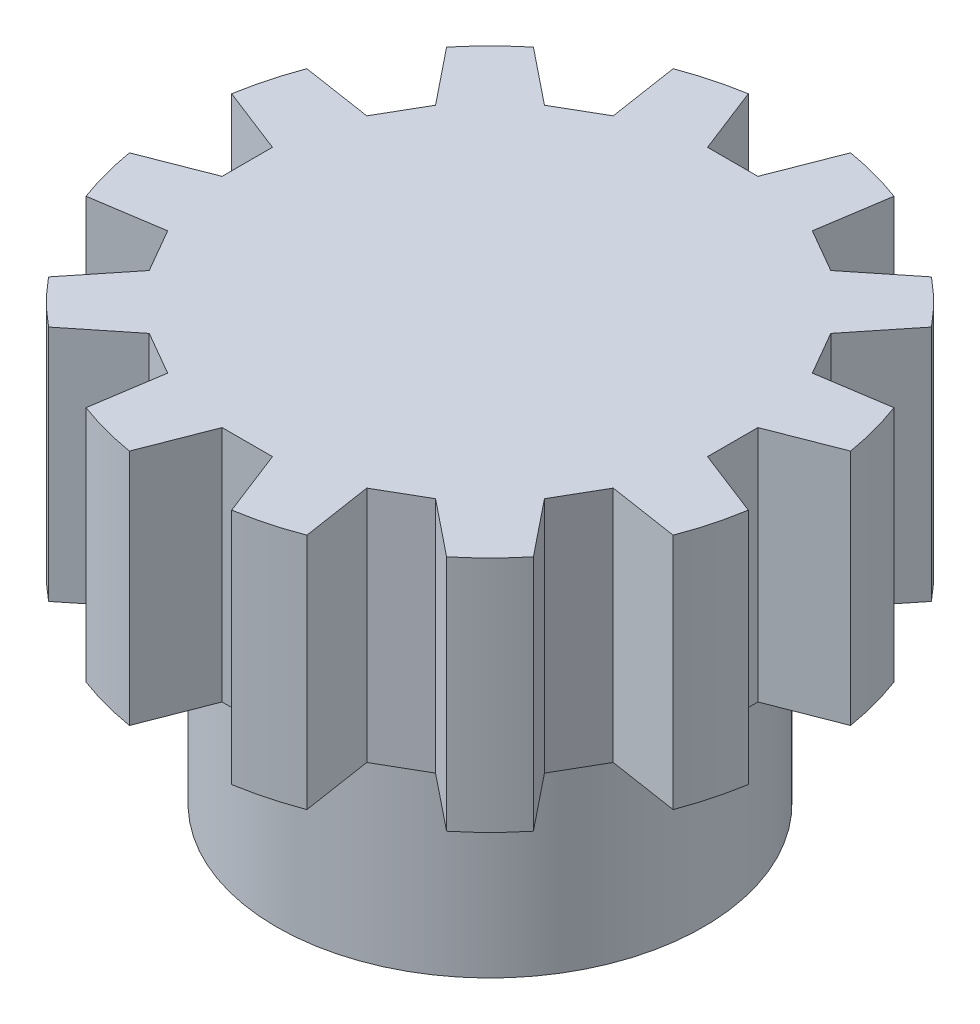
ISO-10303-21;
HEADER;
FILE_DESCRIPTION(('STEP AP214'),'2;1');
FILE_NAME('part.step','',(''),(''),'','','');
FILE_SCHEMA(('AUTOMOTIVE_DESIGN { 1 0 10303 214 1 1 1 1 }'));
ENDSEC;
DATA;
#1=APPLICATION_CONTEXT('core data for automotive mechanical design processes');
#2=APPLICATION_PROTOCOL_DEFINITION('international standard','automotive_design',2000,#1);
#3=PRODUCT_CONTEXT('',#1,'mechanical');
#4=PRODUCT('Part','Part','',(#3));
#5=PRODUCT_RELATED_PRODUCT_CATEGORY('part','',(#4));
#6=PRODUCT_DEFINITION_FORMATION('','',#4);
#7=PRODUCT_DEFINITION_CONTEXT('part definition',#1,'design');
#8=PRODUCT_DEFINITION('design','',#6,#7);
#9=PRODUCT_DEFINITION_SHAPE('','',#8);
#10=(LENGTH_UNIT() NAMED_UNIT(*) SI_UNIT(.MILLI.,.METRE.));
#11=(NAMED_UNIT(*) PLANE_ANGLE_UNIT() SI_UNIT($,.RADIAN.));
#12=(NAMED_UNIT(*) SI_UNIT($,.STERADIAN.) SOLID_ANGLE_UNIT());
#13=UNCERTAINTY_MEASURE_WITH_UNIT(LENGTH_MEASURE(1.E-05),#10,'distance_accuracy_value','');
#14=(GEOMETRIC_REPRESENTATION_CONTEXT(3) GLOBAL_UNCERTAINTY_ASSIGNED_CONTEXT((#13)) GLOBAL_UNIT_ASSIGNED_CONTEXT((#10,
#11,#12)) REPRESENTATION_CONTEXT('',''));
#15=CARTESIAN_POINT('',(0.,0.,0.));
#16=DIRECTION('',(0.,0.,1.));
#17=DIRECTION('',(1.,0.,0.));
#18=AXIS2_PLACEMENT_3D('',#15,#16,#17);
#19=CARTESIAN_POINT('',(6.7945,45.4025,0.));
#20=DIRECTION('',(0.,-1.,0.));
#21=DIRECTION('',(0.,0.,-1.));
#22=AXIS2_PLACEMENT_3D('',#19,#20,#21);
#23=CYLINDRICAL_SURFACE('',#22,5.96900000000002);
#24=CARTESIAN_POINT('',(6.7945,51.3714852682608,0.));
#25=DIRECTION('',(0.,-1.,0.));
#26=DIRECTION('',(0.,0.,-1.));
#27=AXIS2_PLACEMENT_3D('',#24,#25,#26);
#28=CIRCLE('',#27,5.96900000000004);
#29=CARTESIAN_POINT('',(2.18094974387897,51.3714852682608,-3.78736254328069));
#30=VERTEX_POINT('',#29);
#31=CARTESIAN_POINT('',(3.00713745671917,51.3714852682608,-4.61355025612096));
#32=VERTEX_POINT('',#31);
#33=EDGE_CURVE('E682',#30,#32,#28,.T.);
#34=ORIENTED_EDGE('',*,*,#33,.F.);
#35=DIRECTION('',(0.,1.,0.));
#36=VECTOR('',#35,1.);
#37=CARTESIAN_POINT('',(2.18094974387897,47.624,-3.78736254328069));
#38=LINE('',#37,#36);
#39=CARTESIAN_POINT('',(2.18094974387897,55.8940792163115,-3.78736254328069));
#40=VERTEX_POINT('',#39);
#41=EDGE_CURVE('E667',#30,#40,#38,.T.);
#42=ORIENTED_EDGE('',*,*,#41,.T.);
#43=CARTESIAN_POINT('',(6.7945,55.8940792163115,0.));
#44=DIRECTION('',(0.,-1.,0.));
#45=DIRECTION('',(0.,0.,-1.));
#46=AXIS2_PLACEMENT_3D('',#43,#44,#45);
#47=CIRCLE('',#46,5.969);
#48=CARTESIAN_POINT('',(3.0071374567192,55.8940792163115,-4.61355025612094));
#49=VERTEX_POINT('',#48);
#50=EDGE_CURVE('E361',#40,#49,#47,.T.);
#51=ORIENTED_EDGE('',*,*,#50,.T.);
#52=DIRECTION('',(0.,1.,0.));
#53=VECTOR('',#52,1.);
#54=CARTESIAN_POINT('',(3.0071374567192,47.624,-4.61355025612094));
#55=LINE('',#54,#53);
#56=EDGE_CURVE('E961',#32,#49,#55,.T.);
#57=ORIENTED_EDGE('',*,*,#56,.F.);
#58=EDGE_LOOP('',(#34,#42,#51,#57));
#59=FACE_BOUND('',#58,.T.);
#60=ADVANCED_FACE('F353',(#59),#23,.T.);
#61=CARTESIAN_POINT('',(4.69272954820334,51.3714852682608,-5.58672730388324));
#62=VERTEX_POINT('',#61);
#63=CARTESIAN_POINT('',(5.82132295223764,51.3714852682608,-5.88913299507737));
#64=VERTEX_POINT('',#63);
#65=EDGE_CURVE('E685',#62,#64,#28,.T.);
#66=ORIENTED_EDGE('',*,*,#65,.F.);
#67=DIRECTION('',(0.,1.,0.));
#68=VECTOR('',#67,1.);
#69=CARTESIAN_POINT('',(4.69272954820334,47.624,-5.58672730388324));
#70=LINE('',#69,#68);
#71=CARTESIAN_POINT('',(4.69272954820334,55.8940792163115,-5.58672730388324));
#72=VERTEX_POINT('',#71);
#73=EDGE_CURVE('E960',#62,#72,#70,.T.);
#74=ORIENTED_EDGE('',*,*,#73,.T.);
#75=CARTESIAN_POINT('',(5.82132295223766,55.8940792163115,-5.88913299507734));
#76=VERTEX_POINT('',#75);
#77=EDGE_CURVE('E1260',#72,#76,#47,.T.);
#78=ORIENTED_EDGE('',*,*,#77,.T.);
#79=DIRECTION('',(0.,1.,0.));
#80=VECTOR('',#79,1.);
#81=CARTESIAN_POINT('',(5.82132295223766,47.624,-5.88913299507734));
#82=LINE('',#81,#80);
#83=EDGE_CURVE('E935',#64,#76,#82,.T.);
#84=ORIENTED_EDGE('',*,*,#83,.F.);
#85=EDGE_LOOP('',(#66,#74,#78,#84));
#86=FACE_BOUND('',#85,.T.);
#87=ADVANCED_FACE('F1020',(#86),#23,.T.);
#88=CARTESIAN_POINT('',(7.76767704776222,51.3714852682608,-5.88913299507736));
#89=VERTEX_POINT('',#88);
#90=CARTESIAN_POINT('',(8.89627045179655,51.3714852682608,-5.58672730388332));
#91=VERTEX_POINT('',#90);
#92=EDGE_CURVE('E1021',#89,#91,#28,.T.);
#93=ORIENTED_EDGE('',*,*,#92,.F.);
#94=DIRECTION('',(0.,1.,0.));
#95=VECTOR('',#94,1.);
#96=CARTESIAN_POINT('',(7.76767704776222,47.624,-5.88913299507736));
#97=LINE('',#96,#95);
#98=CARTESIAN_POINT('',(7.76767704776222,55.8940792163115,-5.88913299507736));
#99=VERTEX_POINT('',#98);
#100=EDGE_CURVE('E934',#89,#99,#97,.T.);
#101=ORIENTED_EDGE('',*,*,#100,.T.);
#102=CARTESIAN_POINT('',(8.89627045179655,55.8940792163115,-5.58672730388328));
#103=VERTEX_POINT('',#102);
#104=EDGE_CURVE('E1256',#99,#103,#47,.T.);
#105=ORIENTED_EDGE('',*,*,#104,.T.);
#106=DIRECTION('',(0.,1.,0.));
#107=VECTOR('',#106,1.);
#108=CARTESIAN_POINT('',(8.89627045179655,47.624,-5.58672730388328));
#109=LINE('',#108,#107);
#110=EDGE_CURVE('E909',#91,#103,#109,.T.);
#111=ORIENTED_EDGE('',*,*,#110,.F.);
#112=EDGE_LOOP('',(#93,#101,#105,#111));
#113=FACE_BOUND('',#112,.T.);
#114=ADVANCED_FACE('F1100',(#113),#23,.T.);
#115=CARTESIAN_POINT('',(10.5818625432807,51.3714852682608,-4.61355025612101));
#116=VERTEX_POINT('',#115);
#117=CARTESIAN_POINT('',(11.408050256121,51.3714852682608,-3.78736254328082));
#118=VERTEX_POINT('',#117);
#119=EDGE_CURVE('E1022',#116,#118,#28,.T.);
#120=ORIENTED_EDGE('',*,*,#119,.F.);
#121=DIRECTION('',(0.,1.,0.));
#122=VECTOR('',#121,1.);
#123=CARTESIAN_POINT('',(10.5818625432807,47.624,-4.61355025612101));
#124=LINE('',#123,#122);
#125=CARTESIAN_POINT('',(10.5818625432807,55.8940792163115,-4.61355025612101));
#126=VERTEX_POINT('',#125);
#127=EDGE_CURVE('E908',#116,#126,#124,.T.);
#128=ORIENTED_EDGE('',*,*,#127,.T.);
#129=CARTESIAN_POINT('',(11.4080502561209,55.8940792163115,-3.78736254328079));
#130=VERTEX_POINT('',#129);
#131=EDGE_CURVE('E1252',#126,#130,#47,.T.);
#132=ORIENTED_EDGE('',*,*,#131,.T.);
#133=DIRECTION('',(0.,1.,0.));
#134=VECTOR('',#133,1.);
#135=CARTESIAN_POINT('',(11.4080502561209,47.624,-3.78736254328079));
#136=LINE('',#135,#134);
#137=EDGE_CURVE('E883',#118,#130,#136,.T.);
#138=ORIENTED_EDGE('',*,*,#137,.F.);
#139=EDGE_LOOP('',(#120,#128,#132,#138));
#140=FACE_BOUND('',#139,.T.);
#141=ADVANCED_FACE('F1274',(#140),#23,.T.);
#142=CARTESIAN_POINT('',(12.3812273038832,51.3714852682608,-2.10177045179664));
#143=VERTEX_POINT('',#142);
#144=CARTESIAN_POINT('',(12.6836329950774,51.3714852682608,-0.973177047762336));
#145=VERTEX_POINT('',#144);
#146=EDGE_CURVE('E1026',#143,#145,#28,.T.);
#147=ORIENTED_EDGE('',*,*,#146,.F.);
#148=DIRECTION('',(0.,1.,0.));
#149=VECTOR('',#148,1.);
#150=CARTESIAN_POINT('',(12.3812273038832,47.624,-2.10177045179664));
#151=LINE('',#150,#149);
#152=CARTESIAN_POINT('',(12.3812273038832,55.8940792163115,-2.10177045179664));
#153=VERTEX_POINT('',#152);
#154=EDGE_CURVE('E882',#143,#153,#151,.T.);
#155=ORIENTED_EDGE('',*,*,#154,.T.);
#156=CARTESIAN_POINT('',(12.6836329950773,55.8940792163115,-0.973177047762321));
#157=VERTEX_POINT('',#156);
#158=EDGE_CURVE('E1248',#153,#157,#47,.T.);
#159=ORIENTED_EDGE('',*,*,#158,.T.);
#160=DIRECTION('',(0.,1.,0.));
#161=VECTOR('',#160,1.);
#162=CARTESIAN_POINT('',(12.6836329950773,47.624,-0.973177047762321));
#163=LINE('',#162,#161);
#164=EDGE_CURVE('E857',#145,#157,#163,.T.);
#165=ORIENTED_EDGE('',*,*,#164,.F.);
#166=EDGE_LOOP('',(#147,#155,#159,#165));
#167=FACE_BOUND('',#166,.T.);
#168=ADVANCED_FACE('F1280',(#167),#23,.T.);
#169=CARTESIAN_POINT('',(12.6836329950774,51.3714852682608,0.973177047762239));
#170=VERTEX_POINT('',#169);
#171=CARTESIAN_POINT('',(12.3812273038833,51.3714852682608,2.10177045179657));
#172=VERTEX_POINT('',#171);
#173=EDGE_CURVE('E1030',#170,#172,#28,.T.);
#174=ORIENTED_EDGE('',*,*,#173,.F.);
#175=DIRECTION('',(0.,1.,0.));
#176=VECTOR('',#175,1.);
#177=CARTESIAN_POINT('',(12.6836329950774,47.624,0.973177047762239));
#178=LINE('',#177,#176);
#179=CARTESIAN_POINT('',(12.6836329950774,55.8940792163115,0.973177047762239));
#180=VERTEX_POINT('',#179);
#181=EDGE_CURVE('E856',#170,#180,#178,.T.);
#182=ORIENTED_EDGE('',*,*,#181,.T.);
#183=CARTESIAN_POINT('',(12.3812273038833,55.8940792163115,2.10177045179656));
#184=VERTEX_POINT('',#183);
#185=EDGE_CURVE('E1247',#180,#184,#47,.T.);
#186=ORIENTED_EDGE('',*,*,#185,.T.);
#187=DIRECTION('',(0.,1.,0.));
#188=VECTOR('',#187,1.);
#189=CARTESIAN_POINT('',(12.3812273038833,47.624,2.10177045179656));
#190=LINE('',#189,#188);
#191=EDGE_CURVE('E831',#172,#184,#190,.T.);
#192=ORIENTED_EDGE('',*,*,#191,.F.);
#193=EDGE_LOOP('',(#174,#182,#186,#192));
#194=FACE_BOUND('',#193,.T.);
#195=ADVANCED_FACE('F1286',(#194),#23,.T.);
#196=CARTESIAN_POINT('',(11.408050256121,51.3714852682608,3.78736254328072));
#197=VERTEX_POINT('',#196);
#198=CARTESIAN_POINT('',(10.5818625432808,51.3714852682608,4.61355025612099));
#199=VERTEX_POINT('',#198);
#200=EDGE_CURVE('E1034',#197,#199,#28,.T.);
#201=ORIENTED_EDGE('',*,*,#200,.F.);
#202=DIRECTION('',(0.,1.,0.));
#203=VECTOR('',#202,1.);
#204=CARTESIAN_POINT('',(11.408050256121,47.624,3.78736254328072));
#205=LINE('',#204,#203);
#206=CARTESIAN_POINT('',(11.408050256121,55.8940792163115,3.78736254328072));
#207=VERTEX_POINT('',#206);
#208=EDGE_CURVE('E830',#197,#207,#205,.T.);
#209=ORIENTED_EDGE('',*,*,#208,.T.);
#210=CARTESIAN_POINT('',(10.5818625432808,55.8940792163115,4.61355025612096));
#211=VERTEX_POINT('',#210);
#212=EDGE_CURVE('E1061',#207,#211,#47,.T.);
#213=ORIENTED_EDGE('',*,*,#212,.T.);
#214=DIRECTION('',(0.,1.,0.));
#215=VECTOR('',#214,1.);
#216=CARTESIAN_POINT('',(10.5818625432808,47.624,4.61355025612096));
#217=LINE('',#216,#215);
#218=EDGE_CURVE('E805',#199,#211,#217,.T.);
#219=ORIENTED_EDGE('',*,*,#218,.F.);
#220=EDGE_LOOP('',(#201,#209,#213,#219));
#221=FACE_BOUND('',#220,.T.);
#222=ADVANCED_FACE('F1290',(#221),#23,.T.);
#223=CARTESIAN_POINT('',(8.89627045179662,51.3714852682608,5.58672730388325));
#224=VERTEX_POINT('',#223);
#225=CARTESIAN_POINT('',(7.76767704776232,51.3714852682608,5.88913299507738));
#226=VERTEX_POINT('',#225);
#227=EDGE_CURVE('E1038',#224,#226,#28,.T.);
#228=ORIENTED_EDGE('',*,*,#227,.F.);
#229=DIRECTION('',(0.,1.,0.));
#230=VECTOR('',#229,1.);
#231=CARTESIAN_POINT('',(8.89627045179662,47.624,5.58672730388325));
#232=LINE('',#231,#230);
#233=CARTESIAN_POINT('',(8.89627045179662,55.8940792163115,5.58672730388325));
#234=VERTEX_POINT('',#233);
#235=EDGE_CURVE('E804',#224,#234,#232,.T.);
#236=ORIENTED_EDGE('',*,*,#235,.T.);
#237=CARTESIAN_POINT('',(7.7676770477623,55.8940792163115,5.88913299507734));
#238=VERTEX_POINT('',#237);
#239=EDGE_CURVE('E1060',#234,#238,#47,.T.);
#240=ORIENTED_EDGE('',*,*,#239,.T.);
#241=DIRECTION('',(0.,1.,0.));
#242=VECTOR('',#241,1.);
#243=CARTESIAN_POINT('',(7.7676770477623,47.624,5.88913299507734));
#244=LINE('',#243,#242);
#245=EDGE_CURVE('E779',#226,#238,#244,.T.);
#246=ORIENTED_EDGE('',*,*,#245,.F.);
#247=EDGE_LOOP('',(#228,#236,#240,#246));
#248=FACE_BOUND('',#247,.T.);
#249=ADVANCED_FACE('F1234',(#248),#23,.T.);
#250=CARTESIAN_POINT('',(5.82132295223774,51.3714852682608,5.88913299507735));
#251=VERTEX_POINT('',#250);
#252=CARTESIAN_POINT('',(4.69272954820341,51.3714852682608,5.5867273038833));
#253=VERTEX_POINT('',#252);
#254=EDGE_CURVE('E693',#251,#253,#28,.T.);
#255=ORIENTED_EDGE('',*,*,#254,.F.);
#256=DIRECTION('',(0.,1.,0.));
#257=VECTOR('',#256,1.);
#258=CARTESIAN_POINT('',(5.82132295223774,47.624,5.88913299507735));
#259=LINE('',#258,#257);
#260=CARTESIAN_POINT('',(5.82132295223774,55.8940792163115,5.88913299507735));
#261=VERTEX_POINT('',#260);
#262=EDGE_CURVE('E778',#251,#261,#259,.T.);
#263=ORIENTED_EDGE('',*,*,#262,.T.);
#264=CARTESIAN_POINT('',(4.69272954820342,55.8940792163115,5.58672730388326));
#265=VERTEX_POINT('',#264);
#266=EDGE_CURVE('E1058',#261,#265,#47,.T.);
#267=ORIENTED_EDGE('',*,*,#266,.T.);
#268=DIRECTION('',(0.,1.,0.));
#269=VECTOR('',#268,1.);
#270=CARTESIAN_POINT('',(4.69272954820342,47.624,5.58672730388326));
#271=LINE('',#270,#269);
#272=EDGE_CURVE('E753',#253,#265,#271,.T.);
#273=ORIENTED_EDGE('',*,*,#272,.F.);
#274=EDGE_LOOP('',(#255,#263,#267,#273));
#275=FACE_BOUND('',#274,.T.);
#276=ADVANCED_FACE('F1056',(#275),#23,.T.);
#277=CARTESIAN_POINT('',(3.00713745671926,51.3714852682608,4.61355025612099));
#278=VERTEX_POINT('',#277);
#279=CARTESIAN_POINT('',(2.180949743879,51.3714852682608,3.78736254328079));
#280=VERTEX_POINT('',#279);
#281=EDGE_CURVE('E687',#278,#280,#28,.T.);
#282=ORIENTED_EDGE('',*,*,#281,.F.);
#283=DIRECTION('',(0.,1.,0.));
#284=VECTOR('',#283,1.);
#285=CARTESIAN_POINT('',(3.00713745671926,47.624,4.61355025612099));
#286=LINE('',#285,#284);
#287=CARTESIAN_POINT('',(3.00713745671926,55.8940792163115,4.61355025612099));
#288=VERTEX_POINT('',#287);
#289=EDGE_CURVE('E752',#278,#288,#286,.T.);
#290=ORIENTED_EDGE('',*,*,#289,.T.);
#291=CARTESIAN_POINT('',(2.18094974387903,55.8940792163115,3.78736254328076));
#292=VERTEX_POINT('',#291);
#293=EDGE_CURVE('E684',#288,#292,#47,.T.);
#294=ORIENTED_EDGE('',*,*,#293,.T.);
#295=DIRECTION('',(0.,1.,0.));
#296=VECTOR('',#295,1.);
#297=CARTESIAN_POINT('',(2.18094974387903,47.624,3.78736254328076));
#298=LINE('',#297,#296);
#299=EDGE_CURVE('E727',#280,#292,#298,.T.);
#300=ORIENTED_EDGE('',*,*,#299,.F.);
#301=EDGE_LOOP('',(#282,#290,#294,#300));
#302=FACE_BOUND('',#301,.T.);
#303=ADVANCED_FACE('F1066',(#302),#23,.T.);
#304=CARTESIAN_POINT('',(1.20777269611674,51.3714852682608,2.1017704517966));
#305=VERTEX_POINT('',#304);
#306=CARTESIAN_POINT('',(0.905367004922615,51.3714852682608,0.973177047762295));
#307=VERTEX_POINT('',#306);
#308=EDGE_CURVE('E683',#305,#307,#28,.T.);
#309=ORIENTED_EDGE('',*,*,#308,.F.);
#310=DIRECTION('',(0.,1.,0.));
#311=VECTOR('',#310,1.);
#312=CARTESIAN_POINT('',(1.20777269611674,47.624,2.1017704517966));
#313=LINE('',#312,#311);
#314=CARTESIAN_POINT('',(1.20777269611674,55.8940792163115,2.1017704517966));
#315=VERTEX_POINT('',#314);
#316=EDGE_CURVE('E726',#305,#315,#313,.T.);
#317=ORIENTED_EDGE('',*,*,#316,.T.);
#318=CARTESIAN_POINT('',(0.905367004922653,55.8940792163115,0.97317704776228));
#319=VERTEX_POINT('',#318);
#320=EDGE_CURVE('E362',#315,#319,#47,.T.);
#321=ORIENTED_EDGE('',*,*,#320,.T.);
#322=DIRECTION('',(0.,1.,0.));
#323=VECTOR('',#322,1.);
#324=CARTESIAN_POINT('',(0.905367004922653,47.624,0.97317704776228));
#325=LINE('',#324,#323);
#326=EDGE_CURVE('E704',#307,#319,#325,.T.);
#327=ORIENTED_EDGE('',*,*,#326,.F.);
#328=EDGE_LOOP('',(#309,#317,#321,#327));
#329=FACE_BOUND('',#328,.T.);
#330=ADVANCED_FACE('F1103',(#329),#23,.T.);
#331=CARTESIAN_POINT('',(6.79450000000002,47.625,0.));
#332=DIRECTION('',(0.,1.,0.));
#333=DIRECTION('',(0.,0.,1.));
#334=AXIS2_PLACEMENT_3D('',#331,#332,#333);
#335=PLANE('',#334);
#336=CARTESIAN_POINT('',(6.7945,47.625,0.));
#337=DIRECTION('',(0.,-1.,0.));
#338=DIRECTION('',(0.,0.,-1.));
#339=AXIS2_PLACEMENT_3D('',#336,#337,#338);
#340=CIRCLE('',#339,4.064);
#341=CARTESIAN_POINT('',(6.7945,47.625,-4.064));
#342=VERTEX_POINT('',#341);
#343=EDGE_CURVE('E695',#342,#342,#340,.T.);
#344=ORIENTED_EDGE('',*,*,#343,.T.);
#345=EDGE_LOOP('',(#344));
#346=FACE_BOUND('',#345,.T.);
#347=ADVANCED_FACE('F355',(#346),#335,.F.);
#348=CARTESIAN_POINT('',(0.8255,55.8940792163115,0.));
#349=DIRECTION('',(0.,-1.,0.));
#350=DIRECTION('',(0.,0.,-1.));
#351=AXIS2_PLACEMENT_3D('',#348,#349,#350);
#352=PLANE('',#351);
#353=ORIENTED_EDGE('',*,*,#50,.F.);
#354=DIRECTION('',(-0.625812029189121,0.,-0.779973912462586));
#355=VECTOR('',#354,1.);
#356=CARTESIAN_POINT('',(3.03375955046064,55.8940792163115,-2.7244724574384));
#357=LINE('',#356,#355);
#358=CARTESIAN_POINT('',(3.03375955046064,55.8940792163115,-2.7244724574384));
#359=VERTEX_POINT('',#358);
#360=EDGE_CURVE('E675',#359,#40,#357,.T.);
#361=ORIENTED_EDGE('',*,*,#360,.F.);
#362=DIRECTION('',(0.499999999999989,0.,-0.866025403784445));
#363=VECTOR('',#362,1.);
#364=CARTESIAN_POINT('',(2.5546674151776,55.8940792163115,-1.89466053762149));
#365=LINE('',#364,#363);
#366=CARTESIAN_POINT('',(2.5546674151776,55.8940792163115,-1.89466053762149));
#367=VERTEX_POINT('',#366);
#368=EDGE_CURVE('E988',#367,#359,#365,.T.);
#369=ORIENTED_EDGE('',*,*,#368,.F.);
#370=DIRECTION('',(0.988383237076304,0.,0.151982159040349));
#371=VECTOR('',#370,1.);
#372=CARTESIAN_POINT('',(2.5546674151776,55.8940792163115,-1.89466053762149));
#373=LINE('',#372,#371);
#374=CARTESIAN_POINT('',(1.20777269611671,55.8940792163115,-2.10177045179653));
#375=VERTEX_POINT('',#374);
#376=EDGE_CURVE('E991',#375,#367,#373,.T.);
#377=ORIENTED_EDGE('',*,*,#376,.F.);
#378=CARTESIAN_POINT('',(0.905367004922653,55.8940792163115,-0.97317704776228));
#379=VERTEX_POINT('',#378);
#380=EDGE_CURVE('E11',#379,#375,#47,.T.);
#381=ORIENTED_EDGE('',*,*,#380,.F.);
#382=DIRECTION('',(-0.931956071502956,0.,-0.362571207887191));
#383=VECTOR('',#382,1.);
#384=CARTESIAN_POINT('',(2.17536700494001,55.8940792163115,-0.47909213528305));
#385=LINE('',#384,#383);
#386=CARTESIAN_POINT('',(2.17536700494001,55.8940792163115,-0.47909213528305));
#387=VERTEX_POINT('',#386);
#388=EDGE_CURVE('E708',#387,#379,#385,.T.);
#389=ORIENTED_EDGE('',*,*,#388,.F.);
#390=DIRECTION('',(0.,0.,-1.));
#391=VECTOR('',#390,1.);
#392=CARTESIAN_POINT('',(2.17536700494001,55.8940792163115,0.47909213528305));
#393=LINE('',#392,#391);
#394=CARTESIAN_POINT('',(2.17536700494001,55.8940792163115,0.47909213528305));
#395=VERTEX_POINT('',#394);
#396=EDGE_CURVE('E714',#395,#387,#393,.T.);
#397=ORIENTED_EDGE('',*,*,#396,.F.);
#398=DIRECTION('',(0.931956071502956,0.,-0.362571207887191));
#399=VECTOR('',#398,1.);
#400=CARTESIAN_POINT('',(2.17536700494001,55.8940792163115,0.47909213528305));
#401=LINE('',#400,#399);
#402=EDGE_CURVE('E717',#319,#395,#401,.T.);
#403=ORIENTED_EDGE('',*,*,#402,.F.);
#404=ORIENTED_EDGE('',*,*,#320,.F.);
#405=DIRECTION('',(-0.988383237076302,0.,0.151982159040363));
#406=VECTOR('',#405,1.);
#407=CARTESIAN_POINT('',(2.55466741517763,55.8940792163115,1.89466053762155));
#408=LINE('',#407,#406);
#409=CARTESIAN_POINT('',(2.55466741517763,55.8940792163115,1.89466053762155));
#410=VERTEX_POINT('',#409);
#411=EDGE_CURVE('E731',#410,#315,#408,.T.);
#412=ORIENTED_EDGE('',*,*,#411,.F.);
#413=DIRECTION('',(-0.500000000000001,0.,-0.866025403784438));
#414=VECTOR('',#413,1.);
#415=CARTESIAN_POINT('',(3.03375955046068,55.8940792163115,2.72447245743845));
#416=LINE('',#415,#414);
#417=CARTESIAN_POINT('',(3.03375955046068,55.8940792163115,2.72447245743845));
#418=VERTEX_POINT('',#417);
#419=EDGE_CURVE('E738',#418,#410,#416,.T.);
#420=ORIENTED_EDGE('',*,*,#419,.F.);
#421=DIRECTION('',(0.62581202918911,0.,-0.779973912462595));
#422=VECTOR('',#421,1.);
#423=CARTESIAN_POINT('',(3.03375955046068,55.8940792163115,2.72447245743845));
#424=LINE('',#423,#422);
#425=EDGE_CURVE('E741',#292,#418,#424,.T.);
#426=ORIENTED_EDGE('',*,*,#425,.F.);
#427=ORIENTED_EDGE('',*,*,#293,.F.);
#428=DIRECTION('',(-0.779973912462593,0.,0.625812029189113));
#429=VECTOR('',#428,1.);
#430=CARTESIAN_POINT('',(4.07002754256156,55.8940792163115,3.76074044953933));
#431=LINE('',#430,#429);
#432=CARTESIAN_POINT('',(4.07002754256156,55.8940792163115,3.76074044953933));
#433=VERTEX_POINT('',#432);
#434=EDGE_CURVE('E757',#433,#288,#431,.T.);
#435=ORIENTED_EDGE('',*,*,#434,.F.);
#436=DIRECTION('',(-0.86602540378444,0.,-0.499999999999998));
#437=VECTOR('',#436,1.);
#438=CARTESIAN_POINT('',(4.89983946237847,55.8940792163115,4.23983258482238));
#439=LINE('',#438,#437);
#440=CARTESIAN_POINT('',(4.89983946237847,55.8940792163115,4.23983258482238));
#441=VERTEX_POINT('',#440);
#442=EDGE_CURVE('E764',#441,#433,#439,.T.);
#443=ORIENTED_EDGE('',*,*,#442,.F.);
#444=DIRECTION('',(0.15198215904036,0.,-0.988383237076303));
#445=VECTOR('',#444,1.);
#446=CARTESIAN_POINT('',(4.89983946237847,55.8940792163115,4.23983258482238));
#447=LINE('',#446,#445);
#448=EDGE_CURVE('E767',#265,#441,#447,.T.);
#449=ORIENTED_EDGE('',*,*,#448,.F.);
#450=ORIENTED_EDGE('',*,*,#266,.F.);
#451=DIRECTION('',(-0.362571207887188,0.,0.931956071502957));
#452=VECTOR('',#451,1.);
#453=CARTESIAN_POINT('',(6.31540786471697,55.8940792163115,4.61913299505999));
#454=LINE('',#453,#452);
#455=CARTESIAN_POINT('',(6.31540786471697,55.8940792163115,4.61913299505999));
#456=VERTEX_POINT('',#455);
#457=EDGE_CURVE('E783',#456,#261,#454,.T.);
#458=ORIENTED_EDGE('',*,*,#457,.F.);
#459=DIRECTION('',(-1.,0.,0.));
#460=VECTOR('',#459,1.);
#461=CARTESIAN_POINT('',(7.27359213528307,55.8940792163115,4.61913299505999));
#462=LINE('',#461,#460);
#463=CARTESIAN_POINT('',(7.27359213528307,55.8940792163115,4.61913299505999));
#464=VERTEX_POINT('',#463);
#465=EDGE_CURVE('E790',#464,#456,#462,.T.);
#466=ORIENTED_EDGE('',*,*,#465,.F.);
#467=DIRECTION('',(-0.362571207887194,0.,-0.931956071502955));
#468=VECTOR('',#467,1.);
#469=CARTESIAN_POINT('',(7.27359213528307,55.8940792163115,4.61913299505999));
#470=LINE('',#469,#468);
#471=EDGE_CURVE('E793',#238,#464,#470,.T.);
#472=ORIENTED_EDGE('',*,*,#471,.F.);
#473=ORIENTED_EDGE('',*,*,#239,.F.);
#474=DIRECTION('',(0.151982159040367,0.,0.988383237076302));
#475=VECTOR('',#474,1.);
#476=CARTESIAN_POINT('',(8.68916053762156,55.8940792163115,4.23983258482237));
#477=LINE('',#476,#475);
#478=CARTESIAN_POINT('',(8.68916053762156,55.8940792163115,4.23983258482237));
#479=VERTEX_POINT('',#478);
#480=EDGE_CURVE('E809',#479,#234,#477,.T.);
#481=ORIENTED_EDGE('',*,*,#480,.F.);
#482=DIRECTION('',(-0.866025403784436,0.,0.500000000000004));
#483=VECTOR('',#482,1.);
#484=CARTESIAN_POINT('',(9.51897245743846,55.8940792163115,3.76074044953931));
#485=LINE('',#484,#483);
#486=CARTESIAN_POINT('',(9.51897245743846,55.8940792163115,3.76074044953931));
#487=VERTEX_POINT('',#486);
#488=EDGE_CURVE('E816',#487,#479,#485,.T.);
#489=ORIENTED_EDGE('',*,*,#488,.F.);
#490=DIRECTION('',(-0.779973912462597,0.,-0.625812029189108));
#491=VECTOR('',#490,1.);
#492=CARTESIAN_POINT('',(9.51897245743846,55.8940792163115,3.76074044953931));
#493=LINE('',#492,#491);
#494=EDGE_CURVE('E819',#211,#487,#493,.T.);
#495=ORIENTED_EDGE('',*,*,#494,.F.);
#496=ORIENTED_EDGE('',*,*,#212,.F.);
#497=DIRECTION('',(0.625812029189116,0.,0.779973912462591));
#498=VECTOR('',#497,1.);
#499=CARTESIAN_POINT('',(10.5552404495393,55.8940792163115,2.72447245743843));
#500=LINE('',#499,#498);
#501=CARTESIAN_POINT('',(10.5552404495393,55.8940792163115,2.72447245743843));
#502=VERTEX_POINT('',#501);
#503=EDGE_CURVE('E835',#502,#207,#500,.T.);
#504=ORIENTED_EDGE('',*,*,#503,.F.);
#505=DIRECTION('',(-0.499999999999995,0.,0.866025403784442));
#506=VECTOR('',#505,1.);
#507=CARTESIAN_POINT('',(11.0343325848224,55.8940792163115,1.89466053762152));
#508=LINE('',#507,#506);
#509=CARTESIAN_POINT('',(11.0343325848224,55.8940792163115,1.89466053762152));
#510=VERTEX_POINT('',#509);
#511=EDGE_CURVE('E842',#510,#502,#508,.T.);
#512=ORIENTED_EDGE('',*,*,#511,.F.);
#513=DIRECTION('',(-0.988383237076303,0.,-0.151982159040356));
#514=VECTOR('',#513,1.);
#515=CARTESIAN_POINT('',(11.0343325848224,55.8940792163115,1.89466053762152));
#516=LINE('',#515,#514);
#517=EDGE_CURVE('E845',#184,#510,#516,.T.);
#518=ORIENTED_EDGE('',*,*,#517,.F.);
#519=ORIENTED_EDGE('',*,*,#185,.F.);
#520=DIRECTION('',(0.931956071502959,0.,0.362571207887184));
#521=VECTOR('',#520,1.);
#522=CARTESIAN_POINT('',(11.41363299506,55.8940792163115,0.479092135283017));
#523=LINE('',#522,#521);
#524=CARTESIAN_POINT('',(11.41363299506,55.8940792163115,0.479092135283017));
#525=VERTEX_POINT('',#524);
#526=EDGE_CURVE('E861',#525,#180,#523,.T.);
#527=ORIENTED_EDGE('',*,*,#526,.F.);
#528=DIRECTION('',(0.,0.,1.));
#529=VECTOR('',#528,1.);
#530=CARTESIAN_POINT('',(11.41363299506,55.8940792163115,-0.479092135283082));
#531=LINE('',#530,#529);
#532=CARTESIAN_POINT('',(11.41363299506,55.8940792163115,-0.479092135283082));
#533=VERTEX_POINT('',#532);
#534=EDGE_CURVE('E868',#533,#525,#531,.T.);
#535=ORIENTED_EDGE('',*,*,#534,.F.);
#536=DIRECTION('',(-0.931956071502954,0.,0.362571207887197));
#537=VECTOR('',#536,1.);
#538=CARTESIAN_POINT('',(11.41363299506,55.8940792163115,-0.479092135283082));
#539=LINE('',#538,#537);
#540=EDGE_CURVE('E871',#157,#533,#539,.T.);
#541=ORIENTED_EDGE('',*,*,#540,.F.);
#542=ORIENTED_EDGE('',*,*,#158,.F.);
#543=DIRECTION('',(0.988383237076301,0.,-0.15198215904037));
#544=VECTOR('',#543,1.);
#545=CARTESIAN_POINT('',(11.0343325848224,55.8940792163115,-1.89466053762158));
#546=LINE('',#545,#544);
#547=CARTESIAN_POINT('',(11.0343325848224,55.8940792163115,-1.89466053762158));
#548=VERTEX_POINT('',#547);
#549=EDGE_CURVE('E887',#548,#153,#546,.T.);
#550=ORIENTED_EDGE('',*,*,#549,.F.);
#551=DIRECTION('',(0.500000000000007,0.,0.866025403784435));
#552=VECTOR('',#551,1.);
#553=CARTESIAN_POINT('',(10.5552404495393,55.8940792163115,-2.72447245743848));
#554=LINE('',#553,#552);
#555=CARTESIAN_POINT('',(10.5552404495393,55.8940792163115,-2.72447245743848));
#556=VERTEX_POINT('',#555);
#557=EDGE_CURVE('E894',#556,#548,#554,.T.);
#558=ORIENTED_EDGE('',*,*,#557,.F.);
#559=DIRECTION('',(-0.625812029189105,0.,0.779973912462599));
#560=VECTOR('',#559,1.);
#561=CARTESIAN_POINT('',(10.5552404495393,55.8940792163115,-2.72447245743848));
#562=LINE('',#561,#560);
#563=EDGE_CURVE('E897',#130,#556,#562,.T.);
#564=ORIENTED_EDGE('',*,*,#563,.F.);
#565=ORIENTED_EDGE('',*,*,#131,.F.);
#566=DIRECTION('',(0.779973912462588,0.,-0.625812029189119));
#567=VECTOR('',#566,1.);
#568=CARTESIAN_POINT('',(9.51897245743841,55.8940792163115,-3.76074044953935));
#569=LINE('',#568,#567);
#570=CARTESIAN_POINT('',(9.51897245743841,55.8940792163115,-3.76074044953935));
#571=VERTEX_POINT('',#570);
#572=EDGE_CURVE('E913',#571,#126,#569,.T.);
#573=ORIENTED_EDGE('',*,*,#572,.F.);
#574=DIRECTION('',(0.866025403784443,0.,0.499999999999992));
#575=VECTOR('',#574,1.);
#576=CARTESIAN_POINT('',(8.6891605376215,55.8940792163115,-4.23983258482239));
#577=LINE('',#576,#575);
#578=CARTESIAN_POINT('',(8.6891605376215,55.8940792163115,-4.23983258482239));
#579=VERTEX_POINT('',#578);
#580=EDGE_CURVE('E920',#579,#571,#577,.T.);
#581=ORIENTED_EDGE('',*,*,#580,.F.);
#582=DIRECTION('',(-0.151982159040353,0.,0.988383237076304));
#583=VECTOR('',#582,1.);
#584=CARTESIAN_POINT('',(8.6891605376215,55.8940792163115,-4.23983258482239));
#585=LINE('',#584,#583);
#586=EDGE_CURVE('E923',#103,#579,#585,.T.);
#587=ORIENTED_EDGE('',*,*,#586,.F.);
#588=ORIENTED_EDGE('',*,*,#104,.F.);
#589=DIRECTION('',(0.362571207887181,0.,-0.93195607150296));
#590=VECTOR('',#589,1.);
#591=CARTESIAN_POINT('',(7.273592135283,55.8940792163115,-4.61913299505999));
#592=LINE('',#591,#590);
#593=CARTESIAN_POINT('',(7.273592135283,55.8940792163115,-4.61913299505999));
#594=VERTEX_POINT('',#593);
#595=EDGE_CURVE('E939',#594,#99,#592,.T.);
#596=ORIENTED_EDGE('',*,*,#595,.F.);
#597=DIRECTION('',(1.,0.,0.));
#598=VECTOR('',#597,1.);
#599=CARTESIAN_POINT('',(6.3154078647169,55.8940792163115,-4.61913299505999));
#600=LINE('',#599,#598);
#601=CARTESIAN_POINT('',(6.3154078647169,55.8940792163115,-4.61913299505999));
#602=VERTEX_POINT('',#601);
#603=EDGE_CURVE('E946',#602,#594,#600,.T.);
#604=ORIENTED_EDGE('',*,*,#603,.F.);
#605=DIRECTION('',(0.362571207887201,0.,0.931956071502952));
#606=VECTOR('',#605,1.);
#607=CARTESIAN_POINT('',(6.3154078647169,55.8940792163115,-4.61913299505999));
#608=LINE('',#607,#606);
#609=EDGE_CURVE('E949',#76,#602,#608,.T.);
#610=ORIENTED_EDGE('',*,*,#609,.F.);
#611=ORIENTED_EDGE('',*,*,#77,.F.);
#612=DIRECTION('',(-0.151982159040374,0.,-0.988383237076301));
#613=VECTOR('',#612,1.);
#614=CARTESIAN_POINT('',(4.89983946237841,55.8940792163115,-4.23983258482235));
#615=LINE('',#614,#613);
#616=CARTESIAN_POINT('',(4.89983946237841,55.8940792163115,-4.23983258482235));
#617=VERTEX_POINT('',#616);
#618=EDGE_CURVE('E965',#617,#72,#615,.T.);
#619=ORIENTED_EDGE('',*,*,#618,.F.);
#620=DIRECTION('',(0.866025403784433,0.,-0.50000000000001));
#621=VECTOR('',#620,1.);
#622=CARTESIAN_POINT('',(4.07002754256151,55.8940792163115,-3.76074044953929));
#623=LINE('',#622,#621);
#624=CARTESIAN_POINT('',(4.07002754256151,55.8940792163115,-3.76074044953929));
#625=VERTEX_POINT('',#624);
#626=EDGE_CURVE('E972',#625,#617,#623,.T.);
#627=ORIENTED_EDGE('',*,*,#626,.F.);
#628=DIRECTION('',(0.779973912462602,0.,0.625812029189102));
#629=VECTOR('',#628,1.);
#630=CARTESIAN_POINT('',(4.07002754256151,55.8940792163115,-3.76074044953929));
#631=LINE('',#630,#629);
#632=EDGE_CURVE('E975',#49,#625,#631,.T.);
#633=ORIENTED_EDGE('',*,*,#632,.F.);
#634=EDGE_LOOP('',(#353,#361,#369,#377,#381,#389,#397,#403,#404,#412,#420,#426,#427,#435,#443,
#449,#450,#458,#466,#472,#473,#481,#489,#495,#496,#504,#512,#518,#519,#527,#535,#541,#542,#550,
#558,#564,#565,#573,#581,#587,#588,#596,#604,#610,#611,#619,#627,#633));
#635=FACE_BOUND('',#634,.T.);
#636=ADVANCED_FACE('F1009',(#635),#352,.F.);
#637=ORIENTED_EDGE('',*,*,#380,.T.);
#638=DIRECTION('',(0.,1.,0.));
#639=VECTOR('',#638,1.);
#640=CARTESIAN_POINT('',(1.20777269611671,47.624,-2.10177045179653));
#641=LINE('',#640,#639);
#642=CARTESIAN_POINT('',(1.20777269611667,51.3714852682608,-2.10177045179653));
#643=VERTEX_POINT('',#642);
#644=EDGE_CURVE('E662',#643,#375,#641,.T.);
#645=ORIENTED_EDGE('',*,*,#644,.F.);
#646=CARTESIAN_POINT('',(0.905367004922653,51.3714852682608,-0.97317704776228));
#647=VERTEX_POINT('',#646);
#648=EDGE_CURVE('E673',#647,#643,#28,.T.);
#649=ORIENTED_EDGE('',*,*,#648,.F.);
#650=DIRECTION('',(0.,1.,0.));
#651=VECTOR('',#650,1.);
#652=CARTESIAN_POINT('',(0.905367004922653,47.624,-0.97317704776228));
#653=LINE('',#652,#651);
#654=EDGE_CURVE('E703',#647,#379,#653,.T.);
#655=ORIENTED_EDGE('',*,*,#654,.T.);
#656=EDGE_LOOP('',(#637,#645,#649,#655));
#657=FACE_BOUND('',#656,.T.);
#658=ADVANCED_FACE('F671',(#657),#23,.T.);
#659=CARTESIAN_POINT('',(2.7305,51.3714852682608,0.));
#660=DIRECTION('',(0.,1.,0.));
#661=DIRECTION('',(0.,0.,1.));
#662=AXIS2_PLACEMENT_3D('',#659,#660,#661);
#663=PLANE('',#662);
#664=CARTESIAN_POINT('',(6.7945,51.3714852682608,0.));
#665=DIRECTION('',(0.,-1.,0.));
#666=DIRECTION('',(0.,0.,-1.));
#667=AXIS2_PLACEMENT_3D('',#664,#665,#666);
#668=CIRCLE('',#667,4.064);
#669=CARTESIAN_POINT('',(6.7945,51.3714852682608,-4.064));
#670=VERTEX_POINT('',#669);
#671=EDGE_CURVE('E688',#670,#670,#668,.T.);
#672=ORIENTED_EDGE('',*,*,#671,.F.);
#673=EDGE_LOOP('',(#672));
#674=FACE_BOUND('',#673,.T.);
#675=DIRECTION('',(-0.499999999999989,0.,0.866025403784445));
#676=VECTOR('',#675,1.);
#677=CARTESIAN_POINT('',(2.5546674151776,51.3714852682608,-1.89466053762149));
#678=LINE('',#677,#676);
#679=CARTESIAN_POINT('',(3.03375955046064,51.3714852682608,-2.7244724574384));
#680=VERTEX_POINT('',#679);
#681=CARTESIAN_POINT('',(2.5546674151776,51.3714852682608,-1.89466053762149));
#682=VERTEX_POINT('',#681);
#683=EDGE_CURVE('E369',#680,#682,#678,.T.);
#684=ORIENTED_EDGE('',*,*,#683,.F.);
#685=DIRECTION('',(0.625812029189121,0.,0.779973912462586));
#686=VECTOR('',#685,1.);
#687=CARTESIAN_POINT('',(3.03375955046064,51.3714852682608,-2.7244724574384));
#688=LINE('',#687,#686);
#689=EDGE_CURVE('E993',#30,#680,#688,.T.);
#690=ORIENTED_EDGE('',*,*,#689,.F.);
#691=ORIENTED_EDGE('',*,*,#33,.T.);
#692=DIRECTION('',(-0.779973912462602,0.,-0.625812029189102));
#693=VECTOR('',#692,1.);
#694=CARTESIAN_POINT('',(4.07002754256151,51.3714852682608,-3.76074044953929));
#695=LINE('',#694,#693);
#696=CARTESIAN_POINT('',(4.07002754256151,51.3714852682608,-3.7607404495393));
#697=VERTEX_POINT('',#696);
#698=EDGE_CURVE('E957',#697,#32,#695,.T.);
#699=ORIENTED_EDGE('',*,*,#698,.F.);
#700=DIRECTION('',(-0.866025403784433,0.,0.50000000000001));
#701=VECTOR('',#700,1.);
#702=CARTESIAN_POINT('',(4.07002754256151,51.3714852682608,-3.76074044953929));
#703=LINE('',#702,#701);
#704=CARTESIAN_POINT('',(4.89983946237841,51.3714852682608,-4.23983258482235));
#705=VERTEX_POINT('',#704);
#706=EDGE_CURVE('E377',#705,#697,#703,.T.);
#707=ORIENTED_EDGE('',*,*,#706,.F.);
#708=DIRECTION('',(0.151982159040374,0.,0.988383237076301));
#709=VECTOR('',#708,1.);
#710=CARTESIAN_POINT('',(4.89983946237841,51.3714852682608,-4.23983258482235));
#711=LINE('',#710,#709);
#712=EDGE_CURVE('E978',#62,#705,#711,.T.);
#713=ORIENTED_EDGE('',*,*,#712,.F.);
#714=ORIENTED_EDGE('',*,*,#65,.T.);
#715=DIRECTION('',(-0.362571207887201,0.,-0.931956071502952));
#716=VECTOR('',#715,1.);
#717=CARTESIAN_POINT('',(6.3154078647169,51.3714852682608,-4.61913299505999));
#718=LINE('',#717,#716);
#719=CARTESIAN_POINT('',(6.3154078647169,51.3714852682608,-4.61913299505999));
#720=VERTEX_POINT('',#719);
#721=EDGE_CURVE('E931',#720,#64,#718,.T.);
#722=ORIENTED_EDGE('',*,*,#721,.F.);
#723=DIRECTION('',(-1.,0.,0.));
#724=VECTOR('',#723,1.);
#725=CARTESIAN_POINT('',(6.3154078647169,51.3714852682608,-4.61913299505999));
#726=LINE('',#725,#724);
#727=CARTESIAN_POINT('',(7.273592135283,51.3714852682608,-4.61913299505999));
#728=VERTEX_POINT('',#727);
#729=EDGE_CURVE('E955',#728,#720,#726,.T.);
#730=ORIENTED_EDGE('',*,*,#729,.F.);
#731=DIRECTION('',(-0.362571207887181,0.,0.93195607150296));
#732=VECTOR('',#731,1.);
#733=CARTESIAN_POINT('',(7.273592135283,51.3714852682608,-4.61913299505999));
#734=LINE('',#733,#732);
#735=EDGE_CURVE('E952',#89,#728,#734,.T.);
#736=ORIENTED_EDGE('',*,*,#735,.F.);
#737=ORIENTED_EDGE('',*,*,#92,.T.);
#738=DIRECTION('',(0.151982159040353,0.,-0.988383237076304));
#739=VECTOR('',#738,1.);
#740=CARTESIAN_POINT('',(8.6891605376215,51.3714852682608,-4.23983258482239));
#741=LINE('',#740,#739);
#742=CARTESIAN_POINT('',(8.6891605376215,51.3714852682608,-4.23983258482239));
#743=VERTEX_POINT('',#742);
#744=EDGE_CURVE('E905',#743,#91,#741,.T.);
#745=ORIENTED_EDGE('',*,*,#744,.F.);
#746=DIRECTION('',(-0.866025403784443,0.,-0.499999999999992));
#747=VECTOR('',#746,1.);
#748=CARTESIAN_POINT('',(8.6891605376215,51.3714852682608,-4.23983258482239));
#749=LINE('',#748,#747);
#750=CARTESIAN_POINT('',(9.51897245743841,51.3714852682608,-3.76074044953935));
#751=VERTEX_POINT('',#750);
#752=EDGE_CURVE('E929',#751,#743,#749,.T.);
#753=ORIENTED_EDGE('',*,*,#752,.F.);
#754=DIRECTION('',(-0.779973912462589,0.,0.625812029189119));
#755=VECTOR('',#754,1.);
#756=CARTESIAN_POINT('',(9.51897245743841,51.3714852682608,-3.76074044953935));
#757=LINE('',#756,#755);
#758=EDGE_CURVE('E926',#116,#751,#757,.T.);
#759=ORIENTED_EDGE('',*,*,#758,.F.);
#760=ORIENTED_EDGE('',*,*,#119,.T.);
#761=DIRECTION('',(0.625812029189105,0.,-0.7799739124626));
#762=VECTOR('',#761,1.);
#763=CARTESIAN_POINT('',(10.5552404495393,51.3714852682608,-2.72447245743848));
#764=LINE('',#763,#762);
#765=CARTESIAN_POINT('',(10.5552404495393,51.3714852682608,-2.72447245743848));
#766=VERTEX_POINT('',#765);
#767=EDGE_CURVE('E879',#766,#118,#764,.T.);
#768=ORIENTED_EDGE('',*,*,#767,.F.);
#769=DIRECTION('',(-0.500000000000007,0.,-0.866025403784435));
#770=VECTOR('',#769,1.);
#771=CARTESIAN_POINT('',(10.5552404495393,51.3714852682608,-2.72447245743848));
#772=LINE('',#771,#770);
#773=CARTESIAN_POINT('',(11.0343325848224,51.3714852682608,-1.89466053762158));
#774=VERTEX_POINT('',#773);
#775=EDGE_CURVE('E903',#774,#766,#772,.T.);
#776=ORIENTED_EDGE('',*,*,#775,.F.);
#777=DIRECTION('',(-0.988383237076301,0.,0.15198215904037));
#778=VECTOR('',#777,1.);
#779=CARTESIAN_POINT('',(11.0343325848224,51.3714852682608,-1.89466053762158));
#780=LINE('',#779,#778);
#781=EDGE_CURVE('E900',#143,#774,#780,.T.);
#782=ORIENTED_EDGE('',*,*,#781,.F.);
#783=ORIENTED_EDGE('',*,*,#146,.T.);
#784=DIRECTION('',(0.931956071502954,0.,-0.362571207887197));
#785=VECTOR('',#784,1.);
#786=CARTESIAN_POINT('',(11.41363299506,51.3714852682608,-0.479092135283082));
#787=LINE('',#786,#785);
#788=CARTESIAN_POINT('',(11.41363299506,51.3714852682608,-0.479092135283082));
#789=VERTEX_POINT('',#788);
#790=EDGE_CURVE('E853',#789,#145,#787,.T.);
#791=ORIENTED_EDGE('',*,*,#790,.F.);
#792=DIRECTION('',(0.,0.,-1.));
#793=VECTOR('',#792,1.);
#794=CARTESIAN_POINT('',(11.41363299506,51.3714852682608,-0.479092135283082));
#795=LINE('',#794,#793);
#796=CARTESIAN_POINT('',(11.41363299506,51.3714852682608,0.479092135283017));
#797=VERTEX_POINT('',#796);
#798=EDGE_CURVE('E877',#797,#789,#795,.T.);
#799=ORIENTED_EDGE('',*,*,#798,.F.);
#800=DIRECTION('',(-0.931956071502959,0.,-0.362571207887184));
#801=VECTOR('',#800,1.);
#802=CARTESIAN_POINT('',(11.41363299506,51.3714852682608,0.479092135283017));
#803=LINE('',#802,#801);
#804=EDGE_CURVE('E874',#170,#797,#803,.T.);
#805=ORIENTED_EDGE('',*,*,#804,.F.);
#806=ORIENTED_EDGE('',*,*,#173,.T.);
#807=DIRECTION('',(0.988383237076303,0.,0.151982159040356));
#808=VECTOR('',#807,1.);
#809=CARTESIAN_POINT('',(11.0343325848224,51.3714852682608,1.89466053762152));
#810=LINE('',#809,#808);
#811=CARTESIAN_POINT('',(11.0343325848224,51.3714852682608,1.89466053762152));
#812=VERTEX_POINT('',#811);
#813=EDGE_CURVE('E827',#812,#172,#810,.T.);
#814=ORIENTED_EDGE('',*,*,#813,.F.);
#815=DIRECTION('',(0.499999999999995,0.,-0.866025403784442));
#816=VECTOR('',#815,1.);
#817=CARTESIAN_POINT('',(11.0343325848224,51.3714852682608,1.89466053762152));
#818=LINE('',#817,#816);
#819=CARTESIAN_POINT('',(10.5552404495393,51.3714852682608,2.72447245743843));
#820=VERTEX_POINT('',#819);
#821=EDGE_CURVE('E851',#820,#812,#818,.T.);
#822=ORIENTED_EDGE('',*,*,#821,.F.);
#823=DIRECTION('',(-0.625812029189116,0.,-0.779973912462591));
#824=VECTOR('',#823,1.);
#825=CARTESIAN_POINT('',(10.5552404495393,51.3714852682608,2.72447245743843));
#826=LINE('',#825,#824);
#827=EDGE_CURVE('E848',#197,#820,#826,.T.);
#828=ORIENTED_EDGE('',*,*,#827,.F.);
#829=ORIENTED_EDGE('',*,*,#200,.T.);
#830=DIRECTION('',(0.779973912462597,0.,0.625812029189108));
#831=VECTOR('',#830,1.);
#832=CARTESIAN_POINT('',(9.51897245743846,51.3714852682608,3.76074044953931));
#833=LINE('',#832,#831);
#834=CARTESIAN_POINT('',(9.51897245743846,51.3714852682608,3.76074044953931));
#835=VERTEX_POINT('',#834);
#836=EDGE_CURVE('E801',#835,#199,#833,.T.);
#837=ORIENTED_EDGE('',*,*,#836,.F.);
#838=DIRECTION('',(0.866025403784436,0.,-0.500000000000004));
#839=VECTOR('',#838,1.);
#840=CARTESIAN_POINT('',(9.51897245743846,51.3714852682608,3.76074044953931));
#841=LINE('',#840,#839);
#842=CARTESIAN_POINT('',(8.68916053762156,51.3714852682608,4.23983258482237));
#843=VERTEX_POINT('',#842);
#844=EDGE_CURVE('E825',#843,#835,#841,.T.);
#845=ORIENTED_EDGE('',*,*,#844,.F.);
#846=DIRECTION('',(-0.151982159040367,0.,-0.988383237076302));
#847=VECTOR('',#846,1.);
#848=CARTESIAN_POINT('',(8.68916053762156,51.3714852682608,4.23983258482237));
#849=LINE('',#848,#847);
#850=EDGE_CURVE('E822',#224,#843,#849,.T.);
#851=ORIENTED_EDGE('',*,*,#850,.F.);
#852=ORIENTED_EDGE('',*,*,#227,.T.);
#853=DIRECTION('',(0.362571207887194,0.,0.931956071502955));
#854=VECTOR('',#853,1.);
#855=CARTESIAN_POINT('',(7.27359213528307,51.3714852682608,4.61913299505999));
#856=LINE('',#855,#854);
#857=CARTESIAN_POINT('',(7.27359213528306,51.3714852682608,4.61913299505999));
#858=VERTEX_POINT('',#857);
#859=EDGE_CURVE('E775',#858,#226,#856,.T.);
#860=ORIENTED_EDGE('',*,*,#859,.F.);
#861=DIRECTION('',(1.,0.,0.));
#862=VECTOR('',#861,1.);
#863=CARTESIAN_POINT('',(7.27359213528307,51.3714852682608,4.61913299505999));
#864=LINE('',#863,#862);
#865=CARTESIAN_POINT('',(6.31540786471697,51.3714852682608,4.61913299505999));
#866=VERTEX_POINT('',#865);
#867=EDGE_CURVE('E799',#866,#858,#864,.T.);
#868=ORIENTED_EDGE('',*,*,#867,.F.);
#869=DIRECTION('',(0.362571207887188,0.,-0.931956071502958));
#870=VECTOR('',#869,1.);
#871=CARTESIAN_POINT('',(6.31540786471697,51.3714852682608,4.61913299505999));
#872=LINE('',#871,#870);
#873=EDGE_CURVE('E796',#251,#866,#872,.T.);
#874=ORIENTED_EDGE('',*,*,#873,.F.);
#875=ORIENTED_EDGE('',*,*,#254,.T.);
#876=DIRECTION('',(-0.15198215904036,0.,0.988383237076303));
#877=VECTOR('',#876,1.);
#878=CARTESIAN_POINT('',(4.89983946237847,51.3714852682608,4.23983258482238));
#879=LINE('',#878,#877);
#880=CARTESIAN_POINT('',(4.89983946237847,51.3714852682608,4.23983258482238));
#881=VERTEX_POINT('',#880);
#882=EDGE_CURVE('E749',#881,#253,#879,.T.);
#883=ORIENTED_EDGE('',*,*,#882,.F.);
#884=DIRECTION('',(0.86602540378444,0.,0.499999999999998));
#885=VECTOR('',#884,1.);
#886=CARTESIAN_POINT('',(4.89983946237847,51.3714852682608,4.23983258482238));
#887=LINE('',#886,#885);
#888=CARTESIAN_POINT('',(4.07002754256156,51.3714852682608,3.76074044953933));
#889=VERTEX_POINT('',#888);
#890=EDGE_CURVE('E773',#889,#881,#887,.T.);
#891=ORIENTED_EDGE('',*,*,#890,.F.);
#892=DIRECTION('',(0.779973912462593,0.,-0.625812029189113));
#893=VECTOR('',#892,1.);
#894=CARTESIAN_POINT('',(4.07002754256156,51.3714852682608,3.76074044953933));
#895=LINE('',#894,#893);
#896=EDGE_CURVE('E770',#278,#889,#895,.T.);
#897=ORIENTED_EDGE('',*,*,#896,.F.);
#898=ORIENTED_EDGE('',*,*,#281,.T.);
#899=DIRECTION('',(-0.625812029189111,0.,0.779973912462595));
#900=VECTOR('',#899,1.);
#901=CARTESIAN_POINT('',(3.03375955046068,51.3714852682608,2.72447245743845));
#902=LINE('',#901,#900);
#903=CARTESIAN_POINT('',(3.03375955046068,51.3714852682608,2.72447245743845));
#904=VERTEX_POINT('',#903);
#905=EDGE_CURVE('E723',#904,#280,#902,.T.);
#906=ORIENTED_EDGE('',*,*,#905,.F.);
#907=DIRECTION('',(0.500000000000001,0.,0.866025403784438));
#908=VECTOR('',#907,1.);
#909=CARTESIAN_POINT('',(3.03375955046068,51.3714852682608,2.72447245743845));
#910=LINE('',#909,#908);
#911=CARTESIAN_POINT('',(2.55466741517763,51.3714852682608,1.89466053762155));
#912=VERTEX_POINT('',#911);
#913=EDGE_CURVE('E747',#912,#904,#910,.T.);
#914=ORIENTED_EDGE('',*,*,#913,.F.);
#915=DIRECTION('',(0.988383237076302,0.,-0.151982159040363));
#916=VECTOR('',#915,1.);
#917=CARTESIAN_POINT('',(2.55466741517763,51.3714852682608,1.89466053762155));
#918=LINE('',#917,#916);
#919=EDGE_CURVE('E744',#305,#912,#918,.T.);
#920=ORIENTED_EDGE('',*,*,#919,.F.);
#921=ORIENTED_EDGE('',*,*,#308,.T.);
#922=DIRECTION('',(-0.931956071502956,0.,0.362571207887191));
#923=VECTOR('',#922,1.);
#924=CARTESIAN_POINT('',(2.17536700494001,51.3714852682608,0.47909213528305));
#925=LINE('',#924,#923);
#926=CARTESIAN_POINT('',(2.17536700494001,51.3714852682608,0.47909213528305));
#927=VERTEX_POINT('',#926);
#928=EDGE_CURVE('E699',#927,#307,#925,.T.);
#929=ORIENTED_EDGE('',*,*,#928,.F.);
#930=DIRECTION('',(0.,0.,1.));
#931=VECTOR('',#930,1.);
#932=CARTESIAN_POINT('',(2.17536700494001,51.3714852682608,0.47909213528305));
#933=LINE('',#932,#931);
#934=CARTESIAN_POINT('',(2.17536700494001,51.3714852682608,-0.47909213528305));
#935=VERTEX_POINT('',#934);
#936=EDGE_CURVE('E721',#935,#927,#933,.T.);
#937=ORIENTED_EDGE('',*,*,#936,.F.);
#938=DIRECTION('',(0.931956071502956,0.,0.362571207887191));
#939=VECTOR('',#938,1.);
#940=CARTESIAN_POINT('',(2.17536700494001,51.3714852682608,-0.47909213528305));
#941=LINE('',#940,#939);
#942=EDGE_CURVE('E681',#647,#935,#941,.T.);
#943=ORIENTED_EDGE('',*,*,#942,.F.);
#944=ORIENTED_EDGE('',*,*,#648,.T.);
#945=DIRECTION('',(-0.988383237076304,0.,-0.151982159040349));
#946=VECTOR('',#945,1.);
#947=CARTESIAN_POINT('',(2.5546674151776,51.3714852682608,-1.89466053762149));
#948=LINE('',#947,#946);
#949=EDGE_CURVE('E658',#682,#643,#948,.T.);
#950=ORIENTED_EDGE('',*,*,#949,.F.);
#951=EDGE_LOOP('',(#684,#690,#691,#699,#707,#713,#714,#722,#730,#736,#737,#745,#753,#759,#760,
#768,#776,#782,#783,#791,#799,#805,#806,#814,#822,#828,#829,#837,#845,#851,#852,#860,#868,#874,
#875,#883,#891,#897,#898,#906,#914,#920,#921,#929,#937,#943,#944,#950));
#952=FACE_BOUND('',#951,.T.);
#953=ADVANCED_FACE('F678',(#674,#952),#663,.F.);
#954=CARTESIAN_POINT('',(6.7945,45.4025,0.));
#955=DIRECTION('',(0.,-1.,0.));
#956=DIRECTION('',(0.,0.,-1.));
#957=AXIS2_PLACEMENT_3D('',#954,#955,#956);
#958=CYLINDRICAL_SURFACE('',#957,4.064);
#959=ORIENTED_EDGE('',*,*,#343,.F.);
#960=EDGE_LOOP('',(#959));
#961=FACE_BOUND('',#960,.T.);
#962=ORIENTED_EDGE('',*,*,#671,.T.);
#963=EDGE_LOOP('',(#962));
#964=FACE_BOUND('',#963,.T.);
#965=ADVANCED_FACE('F1108',(#961,#964),#958,.T.);
#966=CARTESIAN_POINT('',(2.17536700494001,47.624,-0.47909213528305));
#967=DIRECTION('',(0.362571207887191,0.,-0.931956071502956));
#968=DIRECTION('',(-0.931956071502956,0.,-0.362571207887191));
#969=AXIS2_PLACEMENT_3D('',#966,#967,#968);
#970=PLANE('',#969);
#971=ORIENTED_EDGE('',*,*,#942,.T.);
#972=DIRECTION('',(0.,1.,0.));
#973=VECTOR('',#972,1.);
#974=CARTESIAN_POINT('',(2.17536700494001,47.624,-0.47909213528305));
#975=LINE('',#974,#973);
#976=EDGE_CURVE('E710',#935,#387,#975,.T.);
#977=ORIENTED_EDGE('',*,*,#976,.T.);
#978=ORIENTED_EDGE('',*,*,#388,.T.);
#979=ORIENTED_EDGE('',*,*,#654,.F.);
#980=EDGE_LOOP('',(#971,#977,#978,#979));
#981=FACE_BOUND('',#980,.T.);
#982=ADVANCED_FACE('F1127',(#981),#970,.F.);
#983=CARTESIAN_POINT('',(2.17536700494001,47.624,0.47909213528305));
#984=DIRECTION('',(1.,0.,0.));
#985=DIRECTION('',(0.,0.,-1.));
#986=AXIS2_PLACEMENT_3D('',#983,#984,#985);
#987=PLANE('',#986);
#988=ORIENTED_EDGE('',*,*,#936,.T.);
#989=DIRECTION('',(0.,1.,0.));
#990=VECTOR('',#989,1.);
#991=CARTESIAN_POINT('',(2.17536700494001,47.624,0.47909213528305));
#992=LINE('',#991,#990);
#993=EDGE_CURVE('E707',#927,#395,#992,.T.);
#994=ORIENTED_EDGE('',*,*,#993,.T.);
#995=ORIENTED_EDGE('',*,*,#396,.T.);
#996=ORIENTED_EDGE('',*,*,#976,.F.);
#997=EDGE_LOOP('',(#988,#994,#995,#996));
#998=FACE_BOUND('',#997,.T.);
#999=ADVANCED_FACE('F1125',(#998),#987,.F.);
#1000=CARTESIAN_POINT('',(2.17536700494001,47.624,0.47909213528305));
#1001=DIRECTION('',(0.362571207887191,0.,0.931956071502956));
#1002=DIRECTION('',(0.931956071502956,0.,-0.362571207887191));
#1003=AXIS2_PLACEMENT_3D('',#1000,#1001,#1002);
#1004=PLANE('',#1003);
#1005=ORIENTED_EDGE('',*,*,#928,.T.);
#1006=ORIENTED_EDGE('',*,*,#326,.T.);
#1007=ORIENTED_EDGE('',*,*,#402,.T.);
#1008=ORIENTED_EDGE('',*,*,#993,.F.);
#1009=EDGE_LOOP('',(#1005,#1006,#1007,#1008));
#1010=FACE_BOUND('',#1009,.T.);
#1011=ADVANCED_FACE('F1120',(#1010),#1004,.F.);
#1012=CARTESIAN_POINT('',(2.55466741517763,47.624,1.89466053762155));
#1013=DIRECTION('',(-0.151982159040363,0.,-0.988383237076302));
#1014=DIRECTION('',(-0.988383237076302,0.,0.151982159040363));
#1015=AXIS2_PLACEMENT_3D('',#1012,#1013,#1014);
#1016=PLANE('',#1015);
#1017=ORIENTED_EDGE('',*,*,#919,.T.);
#1018=DIRECTION('',(0.,1.,0.));
#1019=VECTOR('',#1018,1.);
#1020=CARTESIAN_POINT('',(2.55466741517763,47.624,1.89466053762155));
#1021=LINE('',#1020,#1019);
#1022=EDGE_CURVE('E733',#912,#410,#1021,.T.);
#1023=ORIENTED_EDGE('',*,*,#1022,.T.);
#1024=ORIENTED_EDGE('',*,*,#411,.T.);
#1025=ORIENTED_EDGE('',*,*,#316,.F.);
#1026=EDGE_LOOP('',(#1017,#1023,#1024,#1025));
#1027=FACE_BOUND('',#1026,.T.);
#1028=ADVANCED_FACE('F1316',(#1027),#1016,.F.);
#1029=CARTESIAN_POINT('',(3.03375955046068,47.624,2.72447245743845));
#1030=DIRECTION('',(0.866025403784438,0.,-0.500000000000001));
#1031=DIRECTION('',(-0.500000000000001,0.,-0.866025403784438));
#1032=AXIS2_PLACEMENT_3D('',#1029,#1030,#1031);
#1033=PLANE('',#1032);
#1034=ORIENTED_EDGE('',*,*,#913,.T.);
#1035=DIRECTION('',(0.,1.,0.));
#1036=VECTOR('',#1035,1.);
#1037=CARTESIAN_POINT('',(3.03375955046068,47.624,2.72447245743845));
#1038=LINE('',#1037,#1036);
#1039=EDGE_CURVE('E730',#904,#418,#1038,.T.);
#1040=ORIENTED_EDGE('',*,*,#1039,.T.);
#1041=ORIENTED_EDGE('',*,*,#419,.T.);
#1042=ORIENTED_EDGE('',*,*,#1022,.F.);
#1043=EDGE_LOOP('',(#1034,#1040,#1041,#1042));
#1044=FACE_BOUND('',#1043,.T.);
#1045=ADVANCED_FACE('F1077',(#1044),#1033,.F.);
#1046=CARTESIAN_POINT('',(3.03375955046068,47.624,2.72447245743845));
#1047=DIRECTION('',(0.779973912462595,0.,0.625812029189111));
#1048=DIRECTION('',(0.625812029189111,0.,-0.779973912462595));
#1049=AXIS2_PLACEMENT_3D('',#1046,#1047,#1048);
#1050=PLANE('',#1049);
#1051=ORIENTED_EDGE('',*,*,#905,.T.);
#1052=ORIENTED_EDGE('',*,*,#299,.T.);
#1053=ORIENTED_EDGE('',*,*,#425,.T.);
#1054=ORIENTED_EDGE('',*,*,#1039,.F.);
#1055=EDGE_LOOP('',(#1051,#1052,#1053,#1054));
#1056=FACE_BOUND('',#1055,.T.);
#1057=ADVANCED_FACE('F1070',(#1056),#1050,.F.);
#1058=CARTESIAN_POINT('',(4.07002754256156,47.624,3.76074044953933));
#1059=DIRECTION('',(-0.625812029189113,0.,-0.779973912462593));
#1060=DIRECTION('',(-0.779973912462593,0.,0.625812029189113));
#1061=AXIS2_PLACEMENT_3D('',#1058,#1059,#1060);
#1062=PLANE('',#1061);
#1063=ORIENTED_EDGE('',*,*,#896,.T.);
#1064=DIRECTION('',(0.,1.,0.));
#1065=VECTOR('',#1064,1.);
#1066=CARTESIAN_POINT('',(4.07002754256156,47.624,3.76074044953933));
#1067=LINE('',#1066,#1065);
#1068=EDGE_CURVE('E759',#889,#433,#1067,.T.);
#1069=ORIENTED_EDGE('',*,*,#1068,.T.);
#1070=ORIENTED_EDGE('',*,*,#434,.T.);
#1071=ORIENTED_EDGE('',*,*,#289,.F.);
#1072=EDGE_LOOP('',(#1063,#1069,#1070,#1071));
#1073=FACE_BOUND('',#1072,.T.);
#1074=ADVANCED_FACE('F1081',(#1073),#1062,.F.);
#1075=CARTESIAN_POINT('',(4.89983946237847,47.624,4.23983258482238));
#1076=DIRECTION('',(0.499999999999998,0.,-0.86602540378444));
#1077=DIRECTION('',(-0.86602540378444,0.,-0.499999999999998));
#1078=AXIS2_PLACEMENT_3D('',#1075,#1076,#1077);
#1079=PLANE('',#1078);
#1080=ORIENTED_EDGE('',*,*,#890,.T.);
#1081=DIRECTION('',(0.,1.,0.));
#1082=VECTOR('',#1081,1.);
#1083=CARTESIAN_POINT('',(4.89983946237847,47.624,4.23983258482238));
#1084=LINE('',#1083,#1082);
#1085=EDGE_CURVE('E756',#881,#441,#1084,.T.);
#1086=ORIENTED_EDGE('',*,*,#1085,.T.);
#1087=ORIENTED_EDGE('',*,*,#442,.T.);
#1088=ORIENTED_EDGE('',*,*,#1068,.F.);
#1089=EDGE_LOOP('',(#1080,#1086,#1087,#1088));
#1090=FACE_BOUND('',#1089,.T.);
#1091=ADVANCED_FACE('F1084',(#1090),#1079,.F.);
#1092=CARTESIAN_POINT('',(4.89983946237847,47.624,4.23983258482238));
#1093=DIRECTION('',(0.988383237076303,0.,0.15198215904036));
#1094=DIRECTION('',(0.15198215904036,0.,-0.988383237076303));
#1095=AXIS2_PLACEMENT_3D('',#1092,#1093,#1094);
#1096=PLANE('',#1095);
#1097=ORIENTED_EDGE('',*,*,#882,.T.);
#1098=ORIENTED_EDGE('',*,*,#272,.T.);
#1099=ORIENTED_EDGE('',*,*,#448,.T.);
#1100=ORIENTED_EDGE('',*,*,#1085,.F.);
#1101=EDGE_LOOP('',(#1097,#1098,#1099,#1100));
#1102=FACE_BOUND('',#1101,.T.);
#1103=ADVANCED_FACE('F1054',(#1102),#1096,.F.);
#1104=CARTESIAN_POINT('',(6.31540786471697,47.624,4.61913299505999));
#1105=DIRECTION('',(-0.931956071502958,0.,-0.362571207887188));
#1106=DIRECTION('',(-0.362571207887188,0.,0.931956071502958));
#1107=AXIS2_PLACEMENT_3D('',#1104,#1105,#1106);
#1108=PLANE('',#1107);
#1109=ORIENTED_EDGE('',*,*,#873,.T.);
#1110=DIRECTION('',(0.,1.,0.));
#1111=VECTOR('',#1110,1.);
#1112=CARTESIAN_POINT('',(6.31540786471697,47.624,4.61913299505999));
#1113=LINE('',#1112,#1111);
#1114=EDGE_CURVE('E785',#866,#456,#1113,.T.);
#1115=ORIENTED_EDGE('',*,*,#1114,.T.);
#1116=ORIENTED_EDGE('',*,*,#457,.T.);
#1117=ORIENTED_EDGE('',*,*,#262,.F.);
#1118=EDGE_LOOP('',(#1109,#1115,#1116,#1117));
#1119=FACE_BOUND('',#1118,.T.);
#1120=ADVANCED_FACE('F1091',(#1119),#1108,.F.);
#1121=CARTESIAN_POINT('',(7.27359213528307,47.624,4.61913299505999));
#1122=DIRECTION('',(0.,0.,-1.));
#1123=DIRECTION('',(-1.,0.,0.));
#1124=AXIS2_PLACEMENT_3D('',#1121,#1122,#1123);
#1125=PLANE('',#1124);
#1126=ORIENTED_EDGE('',*,*,#867,.T.);
#1127=DIRECTION('',(0.,1.,0.));
#1128=VECTOR('',#1127,1.);
#1129=CARTESIAN_POINT('',(7.27359213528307,47.624,4.61913299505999));
#1130=LINE('',#1129,#1128);
#1131=EDGE_CURVE('E782',#858,#464,#1130,.T.);
#1132=ORIENTED_EDGE('',*,*,#1131,.T.);
#1133=ORIENTED_EDGE('',*,*,#465,.T.);
#1134=ORIENTED_EDGE('',*,*,#1114,.F.);
#1135=EDGE_LOOP('',(#1126,#1132,#1133,#1134));
#1136=FACE_BOUND('',#1135,.T.);
#1137=ADVANCED_FACE('F1221',(#1136),#1125,.F.);
#1138=CARTESIAN_POINT('',(7.27359213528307,47.624,4.61913299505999));
#1139=DIRECTION('',(0.931956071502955,0.,-0.362571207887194));
#1140=DIRECTION('',(-0.362571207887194,0.,-0.931956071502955));
#1141=AXIS2_PLACEMENT_3D('',#1138,#1139,#1140);
#1142=PLANE('',#1141);
#1143=ORIENTED_EDGE('',*,*,#859,.T.);
#1144=ORIENTED_EDGE('',*,*,#245,.T.);
#1145=ORIENTED_EDGE('',*,*,#471,.T.);
#1146=ORIENTED_EDGE('',*,*,#1131,.F.);
#1147=EDGE_LOOP('',(#1143,#1144,#1145,#1146));
#1148=FACE_BOUND('',#1147,.T.);
#1149=ADVANCED_FACE('F1211',(#1148),#1142,.F.);
#1150=CARTESIAN_POINT('',(8.68916053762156,47.624,4.23983258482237));
#1151=DIRECTION('',(-0.988383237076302,0.,0.151982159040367));
#1152=DIRECTION('',(0.151982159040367,0.,0.988383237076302));
#1153=AXIS2_PLACEMENT_3D('',#1150,#1151,#1152);
#1154=PLANE('',#1153);
#1155=ORIENTED_EDGE('',*,*,#850,.T.);
#1156=DIRECTION('',(0.,1.,0.));
#1157=VECTOR('',#1156,1.);
#1158=CARTESIAN_POINT('',(8.68916053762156,47.624,4.23983258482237));
#1159=LINE('',#1158,#1157);
#1160=EDGE_CURVE('E811',#843,#479,#1159,.T.);
#1161=ORIENTED_EDGE('',*,*,#1160,.T.);
#1162=ORIENTED_EDGE('',*,*,#480,.T.);
#1163=ORIENTED_EDGE('',*,*,#235,.F.);
#1164=EDGE_LOOP('',(#1155,#1161,#1162,#1163));
#1165=FACE_BOUND('',#1164,.T.);
#1166=ADVANCED_FACE('F1207',(#1165),#1154,.F.);
#1167=CARTESIAN_POINT('',(9.51897245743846,47.624,3.76074044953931));
#1168=DIRECTION('',(-0.500000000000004,0.,-0.866025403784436));
#1169=DIRECTION('',(-0.866025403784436,0.,0.500000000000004));
#1170=AXIS2_PLACEMENT_3D('',#1167,#1168,#1169);
#1171=PLANE('',#1170);
#1172=ORIENTED_EDGE('',*,*,#844,.T.);
#1173=DIRECTION('',(0.,1.,0.));
#1174=VECTOR('',#1173,1.);
#1175=CARTESIAN_POINT('',(9.51897245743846,47.624,3.76074044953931));
#1176=LINE('',#1175,#1174);
#1177=EDGE_CURVE('E808',#835,#487,#1176,.T.);
#1178=ORIENTED_EDGE('',*,*,#1177,.T.);
#1179=ORIENTED_EDGE('',*,*,#488,.T.);
#1180=ORIENTED_EDGE('',*,*,#1160,.F.);
#1181=EDGE_LOOP('',(#1172,#1178,#1179,#1180));
#1182=FACE_BOUND('',#1181,.T.);
#1183=ADVANCED_FACE('F1210',(#1182),#1171,.F.);
#1184=CARTESIAN_POINT('',(9.51897245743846,47.624,3.76074044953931));
#1185=DIRECTION('',(0.625812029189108,0.,-0.779973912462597));
#1186=DIRECTION('',(-0.779973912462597,0.,-0.625812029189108));
#1187=AXIS2_PLACEMENT_3D('',#1184,#1185,#1186);
#1188=PLANE('',#1187);
#1189=ORIENTED_EDGE('',*,*,#836,.T.);
#1190=ORIENTED_EDGE('',*,*,#218,.T.);
#1191=ORIENTED_EDGE('',*,*,#494,.T.);
#1192=ORIENTED_EDGE('',*,*,#1177,.F.);
#1193=EDGE_LOOP('',(#1189,#1190,#1191,#1192));
#1194=FACE_BOUND('',#1193,.T.);
#1195=ADVANCED_FACE('F1199',(#1194),#1188,.F.);
#1196=CARTESIAN_POINT('',(10.5552404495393,47.624,2.72447245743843));
#1197=DIRECTION('',(-0.779973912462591,0.,0.625812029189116));
#1198=DIRECTION('',(0.625812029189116,0.,0.779973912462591));
#1199=AXIS2_PLACEMENT_3D('',#1196,#1197,#1198);
#1200=PLANE('',#1199);
#1201=ORIENTED_EDGE('',*,*,#827,.T.);
#1202=DIRECTION('',(0.,1.,0.));
#1203=VECTOR('',#1202,1.);
#1204=CARTESIAN_POINT('',(10.5552404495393,47.624,2.72447245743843));
#1205=LINE('',#1204,#1203);
#1206=EDGE_CURVE('E837',#820,#502,#1205,.T.);
#1207=ORIENTED_EDGE('',*,*,#1206,.T.);
#1208=ORIENTED_EDGE('',*,*,#503,.T.);
#1209=ORIENTED_EDGE('',*,*,#208,.F.);
#1210=EDGE_LOOP('',(#1201,#1207,#1208,#1209));
#1211=FACE_BOUND('',#1210,.T.);
#1212=ADVANCED_FACE('F1195',(#1211),#1200,.F.);
#1213=CARTESIAN_POINT('',(11.0343325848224,47.624,1.89466053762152));
#1214=DIRECTION('',(-0.866025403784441,0.,-0.499999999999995));
#1215=DIRECTION('',(-0.499999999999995,0.,0.866025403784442));
#1216=AXIS2_PLACEMENT_3D('',#1213,#1214,#1215);
#1217=PLANE('',#1216);
#1218=ORIENTED_EDGE('',*,*,#821,.T.);
#1219=DIRECTION('',(0.,1.,0.));
#1220=VECTOR('',#1219,1.);
#1221=CARTESIAN_POINT('',(11.0343325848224,47.624,1.89466053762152));
#1222=LINE('',#1221,#1220);
#1223=EDGE_CURVE('E834',#812,#510,#1222,.T.);
#1224=ORIENTED_EDGE('',*,*,#1223,.T.);
#1225=ORIENTED_EDGE('',*,*,#511,.T.);
#1226=ORIENTED_EDGE('',*,*,#1206,.F.);
#1227=EDGE_LOOP('',(#1218,#1224,#1225,#1226));
#1228=FACE_BOUND('',#1227,.T.);
#1229=ADVANCED_FACE('F1198',(#1228),#1217,.F.);
#1230=CARTESIAN_POINT('',(11.0343325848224,47.624,1.89466053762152));
#1231=DIRECTION('',(0.151982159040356,0.,-0.988383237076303));
#1232=DIRECTION('',(-0.988383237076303,0.,-0.151982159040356));
#1233=AXIS2_PLACEMENT_3D('',#1230,#1231,#1232);
#1234=PLANE('',#1233);
#1235=ORIENTED_EDGE('',*,*,#813,.T.);
#1236=ORIENTED_EDGE('',*,*,#191,.T.);
#1237=ORIENTED_EDGE('',*,*,#517,.T.);
#1238=ORIENTED_EDGE('',*,*,#1223,.F.);
#1239=EDGE_LOOP('',(#1235,#1236,#1237,#1238));
#1240=FACE_BOUND('',#1239,.T.);
#1241=ADVANCED_FACE('F1187',(#1240),#1234,.F.);
#1242=CARTESIAN_POINT('',(11.41363299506,47.624,0.479092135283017));
#1243=DIRECTION('',(-0.362571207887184,0.,0.931956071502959));
#1244=DIRECTION('',(0.931956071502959,0.,0.362571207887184));
#1245=AXIS2_PLACEMENT_3D('',#1242,#1243,#1244);
#1246=PLANE('',#1245);
#1247=ORIENTED_EDGE('',*,*,#804,.T.);
#1248=DIRECTION('',(0.,1.,0.));
#1249=VECTOR('',#1248,1.);
#1250=CARTESIAN_POINT('',(11.41363299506,47.624,0.479092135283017));
#1251=LINE('',#1250,#1249);
#1252=EDGE_CURVE('E863',#797,#525,#1251,.T.);
#1253=ORIENTED_EDGE('',*,*,#1252,.T.);
#1254=ORIENTED_EDGE('',*,*,#526,.T.);
#1255=ORIENTED_EDGE('',*,*,#181,.F.);
#1256=EDGE_LOOP('',(#1247,#1253,#1254,#1255));
#1257=FACE_BOUND('',#1256,.T.);
#1258=ADVANCED_FACE('F1183',(#1257),#1246,.F.);
#1259=CARTESIAN_POINT('',(11.41363299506,47.624,-0.479092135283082));
#1260=DIRECTION('',(-1.,0.,0.));
#1261=DIRECTION('',(0.,0.,1.));
#1262=AXIS2_PLACEMENT_3D('',#1259,#1260,#1261);
#1263=PLANE('',#1262);
#1264=ORIENTED_EDGE('',*,*,#798,.T.);
#1265=DIRECTION('',(0.,1.,0.));
#1266=VECTOR('',#1265,1.);
#1267=CARTESIAN_POINT('',(11.41363299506,47.624,-0.479092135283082));
#1268=LINE('',#1267,#1266);
#1269=EDGE_CURVE('E860',#789,#533,#1268,.T.);
#1270=ORIENTED_EDGE('',*,*,#1269,.T.);
#1271=ORIENTED_EDGE('',*,*,#534,.T.);
#1272=ORIENTED_EDGE('',*,*,#1252,.F.);
#1273=EDGE_LOOP('',(#1264,#1270,#1271,#1272));
#1274=FACE_BOUND('',#1273,.T.);
#1275=ADVANCED_FACE('F1186',(#1274),#1263,.F.);
#1276=CARTESIAN_POINT('',(11.41363299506,47.624,-0.479092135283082));
#1277=DIRECTION('',(-0.362571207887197,0.,-0.931956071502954));
#1278=DIRECTION('',(-0.931956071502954,0.,0.362571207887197));
#1279=AXIS2_PLACEMENT_3D('',#1276,#1277,#1278);
#1280=PLANE('',#1279);
#1281=ORIENTED_EDGE('',*,*,#790,.T.);
#1282=ORIENTED_EDGE('',*,*,#164,.T.);
#1283=ORIENTED_EDGE('',*,*,#540,.T.);
#1284=ORIENTED_EDGE('',*,*,#1269,.F.);
#1285=EDGE_LOOP('',(#1281,#1282,#1283,#1284));
#1286=FACE_BOUND('',#1285,.T.);
#1287=ADVANCED_FACE('F1175',(#1286),#1280,.F.);
#1288=CARTESIAN_POINT('',(11.0343325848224,47.624,-1.89466053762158));
#1289=DIRECTION('',(0.15198215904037,0.,0.988383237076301));
#1290=DIRECTION('',(0.988383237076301,0.,-0.15198215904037));
#1291=AXIS2_PLACEMENT_3D('',#1288,#1289,#1290);
#1292=PLANE('',#1291);
#1293=ORIENTED_EDGE('',*,*,#781,.T.);
#1294=DIRECTION('',(0.,1.,0.));
#1295=VECTOR('',#1294,1.);
#1296=CARTESIAN_POINT('',(11.0343325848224,47.624,-1.89466053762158));
#1297=LINE('',#1296,#1295);
#1298=EDGE_CURVE('E889',#774,#548,#1297,.T.);
#1299=ORIENTED_EDGE('',*,*,#1298,.T.);
#1300=ORIENTED_EDGE('',*,*,#549,.T.);
#1301=ORIENTED_EDGE('',*,*,#154,.F.);
#1302=EDGE_LOOP('',(#1293,#1299,#1300,#1301));
#1303=FACE_BOUND('',#1302,.T.);
#1304=ADVANCED_FACE('F1171',(#1303),#1292,.F.);
#1305=CARTESIAN_POINT('',(10.5552404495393,47.624,-2.72447245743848));
#1306=DIRECTION('',(-0.866025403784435,0.,0.500000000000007));
#1307=DIRECTION('',(0.500000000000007,0.,0.866025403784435));
#1308=AXIS2_PLACEMENT_3D('',#1305,#1306,#1307);
#1309=PLANE('',#1308);
#1310=ORIENTED_EDGE('',*,*,#775,.T.);
#1311=DIRECTION('',(0.,1.,0.));
#1312=VECTOR('',#1311,1.);
#1313=CARTESIAN_POINT('',(10.5552404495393,47.624,-2.72447245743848));
#1314=LINE('',#1313,#1312);
#1315=EDGE_CURVE('E886',#766,#556,#1314,.T.);
#1316=ORIENTED_EDGE('',*,*,#1315,.T.);
#1317=ORIENTED_EDGE('',*,*,#557,.T.);
#1318=ORIENTED_EDGE('',*,*,#1298,.F.);
#1319=EDGE_LOOP('',(#1310,#1316,#1317,#1318));
#1320=FACE_BOUND('',#1319,.T.);
#1321=ADVANCED_FACE('F1174',(#1320),#1309,.F.);
#1322=CARTESIAN_POINT('',(10.5552404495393,47.624,-2.72447245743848));
#1323=DIRECTION('',(-0.779973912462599,0.,-0.625812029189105));
#1324=DIRECTION('',(-0.625812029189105,0.,0.7799739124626));
#1325=AXIS2_PLACEMENT_3D('',#1322,#1323,#1324);
#1326=PLANE('',#1325);
#1327=ORIENTED_EDGE('',*,*,#767,.T.);
#1328=ORIENTED_EDGE('',*,*,#137,.T.);
#1329=ORIENTED_EDGE('',*,*,#563,.T.);
#1330=ORIENTED_EDGE('',*,*,#1315,.F.);
#1331=EDGE_LOOP('',(#1327,#1328,#1329,#1330));
#1332=FACE_BOUND('',#1331,.T.);
#1333=ADVANCED_FACE('F1163',(#1332),#1326,.F.);
#1334=CARTESIAN_POINT('',(9.51897245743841,47.624,-3.76074044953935));
#1335=DIRECTION('',(0.625812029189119,0.,0.779973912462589));
#1336=DIRECTION('',(0.779973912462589,0.,-0.625812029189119));
#1337=AXIS2_PLACEMENT_3D('',#1334,#1335,#1336);
#1338=PLANE('',#1337);
#1339=ORIENTED_EDGE('',*,*,#758,.T.);
#1340=DIRECTION('',(0.,1.,0.));
#1341=VECTOR('',#1340,1.);
#1342=CARTESIAN_POINT('',(9.51897245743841,47.624,-3.76074044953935));
#1343=LINE('',#1342,#1341);
#1344=EDGE_CURVE('E915',#751,#571,#1343,.T.);
#1345=ORIENTED_EDGE('',*,*,#1344,.T.);
#1346=ORIENTED_EDGE('',*,*,#572,.T.);
#1347=ORIENTED_EDGE('',*,*,#127,.F.);
#1348=EDGE_LOOP('',(#1339,#1345,#1346,#1347));
#1349=FACE_BOUND('',#1348,.T.);
#1350=ADVANCED_FACE('F1159',(#1349),#1338,.F.);
#1351=CARTESIAN_POINT('',(8.6891605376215,47.624,-4.23983258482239));
#1352=DIRECTION('',(-0.499999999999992,0.,0.866025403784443));
#1353=DIRECTION('',(0.866025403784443,0.,0.499999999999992));
#1354=AXIS2_PLACEMENT_3D('',#1351,#1352,#1353);
#1355=PLANE('',#1354);
#1356=ORIENTED_EDGE('',*,*,#752,.T.);
#1357=DIRECTION('',(0.,1.,0.));
#1358=VECTOR('',#1357,1.);
#1359=CARTESIAN_POINT('',(8.6891605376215,47.624,-4.23983258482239));
#1360=LINE('',#1359,#1358);
#1361=EDGE_CURVE('E912',#743,#579,#1360,.T.);
#1362=ORIENTED_EDGE('',*,*,#1361,.T.);
#1363=ORIENTED_EDGE('',*,*,#580,.T.);
#1364=ORIENTED_EDGE('',*,*,#1344,.F.);
#1365=EDGE_LOOP('',(#1356,#1362,#1363,#1364));
#1366=FACE_BOUND('',#1365,.T.);
#1367=ADVANCED_FACE('F1162',(#1366),#1355,.F.);
#1368=CARTESIAN_POINT('',(8.6891605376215,47.624,-4.23983258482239));
#1369=DIRECTION('',(-0.988383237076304,0.,-0.151982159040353));
#1370=DIRECTION('',(-0.151982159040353,0.,0.988383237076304));
#1371=AXIS2_PLACEMENT_3D('',#1368,#1369,#1370);
#1372=PLANE('',#1371);
#1373=ORIENTED_EDGE('',*,*,#744,.T.);
#1374=ORIENTED_EDGE('',*,*,#110,.T.);
#1375=ORIENTED_EDGE('',*,*,#586,.T.);
#1376=ORIENTED_EDGE('',*,*,#1361,.F.);
#1377=EDGE_LOOP('',(#1373,#1374,#1375,#1376));
#1378=FACE_BOUND('',#1377,.T.);
#1379=ADVANCED_FACE('F1151',(#1378),#1372,.F.);
#1380=CARTESIAN_POINT('',(7.273592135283,47.624,-4.61913299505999));
#1381=DIRECTION('',(0.93195607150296,0.,0.362571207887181));
#1382=DIRECTION('',(0.362571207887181,0.,-0.93195607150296));
#1383=AXIS2_PLACEMENT_3D('',#1380,#1381,#1382);
#1384=PLANE('',#1383);
#1385=ORIENTED_EDGE('',*,*,#735,.T.);
#1386=DIRECTION('',(0.,1.,0.));
#1387=VECTOR('',#1386,1.);
#1388=CARTESIAN_POINT('',(7.273592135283,47.624,-4.61913299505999));
#1389=LINE('',#1388,#1387);
#1390=EDGE_CURVE('E941',#728,#594,#1389,.T.);
#1391=ORIENTED_EDGE('',*,*,#1390,.T.);
#1392=ORIENTED_EDGE('',*,*,#595,.T.);
#1393=ORIENTED_EDGE('',*,*,#100,.F.);
#1394=EDGE_LOOP('',(#1385,#1391,#1392,#1393));
#1395=FACE_BOUND('',#1394,.T.);
#1396=ADVANCED_FACE('F1147',(#1395),#1384,.F.);
#1397=CARTESIAN_POINT('',(6.3154078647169,47.624,-4.61913299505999));
#1398=DIRECTION('',(0.,0.,1.));
#1399=DIRECTION('',(1.,0.,0.));
#1400=AXIS2_PLACEMENT_3D('',#1397,#1398,#1399);
#1401=PLANE('',#1400);
#1402=ORIENTED_EDGE('',*,*,#729,.T.);
#1403=DIRECTION('',(0.,1.,0.));
#1404=VECTOR('',#1403,1.);
#1405=CARTESIAN_POINT('',(6.3154078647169,47.624,-4.61913299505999));
#1406=LINE('',#1405,#1404);
#1407=EDGE_CURVE('E938',#720,#602,#1406,.T.);
#1408=ORIENTED_EDGE('',*,*,#1407,.T.);
#1409=ORIENTED_EDGE('',*,*,#603,.T.);
#1410=ORIENTED_EDGE('',*,*,#1390,.F.);
#1411=EDGE_LOOP('',(#1402,#1408,#1409,#1410));
#1412=FACE_BOUND('',#1411,.T.);
#1413=ADVANCED_FACE('F1150',(#1412),#1401,.F.);
#1414=CARTESIAN_POINT('',(6.3154078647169,47.624,-4.61913299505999));
#1415=DIRECTION('',(-0.931956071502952,0.,0.362571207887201));
#1416=DIRECTION('',(0.362571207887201,0.,0.931956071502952));
#1417=AXIS2_PLACEMENT_3D('',#1414,#1415,#1416);
#1418=PLANE('',#1417);
#1419=ORIENTED_EDGE('',*,*,#721,.T.);
#1420=ORIENTED_EDGE('',*,*,#83,.T.);
#1421=ORIENTED_EDGE('',*,*,#609,.T.);
#1422=ORIENTED_EDGE('',*,*,#1407,.F.);
#1423=EDGE_LOOP('',(#1419,#1420,#1421,#1422));
#1424=FACE_BOUND('',#1423,.T.);
#1425=ADVANCED_FACE('F1142',(#1424),#1418,.F.);
#1426=CARTESIAN_POINT('',(4.89983946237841,47.624,-4.23983258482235));
#1427=DIRECTION('',(0.988383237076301,0.,-0.151982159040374));
#1428=DIRECTION('',(-0.151982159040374,0.,-0.988383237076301));
#1429=AXIS2_PLACEMENT_3D('',#1426,#1427,#1428);
#1430=PLANE('',#1429);
#1431=ORIENTED_EDGE('',*,*,#712,.T.);
#1432=DIRECTION('',(0.,1.,0.));
#1433=VECTOR('',#1432,1.);
#1434=CARTESIAN_POINT('',(4.89983946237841,47.624,-4.23983258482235));
#1435=LINE('',#1434,#1433);
#1436=EDGE_CURVE('E967',#705,#617,#1435,.T.);
#1437=ORIENTED_EDGE('',*,*,#1436,.T.);
#1438=ORIENTED_EDGE('',*,*,#618,.T.);
#1439=ORIENTED_EDGE('',*,*,#73,.F.);
#1440=EDGE_LOOP('',(#1431,#1437,#1438,#1439));
#1441=FACE_BOUND('',#1440,.T.);
#1442=ADVANCED_FACE('F1139',(#1441),#1430,.F.);
#1443=CARTESIAN_POINT('',(4.07002754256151,47.624,-3.76074044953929));
#1444=DIRECTION('',(0.50000000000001,0.,0.866025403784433));
#1445=DIRECTION('',(0.866025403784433,0.,-0.50000000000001));
#1446=AXIS2_PLACEMENT_3D('',#1443,#1444,#1445);
#1447=PLANE('',#1446);
#1448=ORIENTED_EDGE('',*,*,#706,.T.);
#1449=DIRECTION('',(0.,1.,0.));
#1450=VECTOR('',#1449,1.);
#1451=CARTESIAN_POINT('',(4.07002754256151,47.624,-3.76074044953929));
#1452=LINE('',#1451,#1450);
#1453=EDGE_CURVE('E964',#697,#625,#1452,.T.);
#1454=ORIENTED_EDGE('',*,*,#1453,.T.);
#1455=ORIENTED_EDGE('',*,*,#626,.T.);
#1456=ORIENTED_EDGE('',*,*,#1436,.F.);
#1457=EDGE_LOOP('',(#1448,#1454,#1455,#1456));
#1458=FACE_BOUND('',#1457,.T.);
#1459=ADVANCED_FACE('F1013',(#1458),#1447,.F.);
#1460=CARTESIAN_POINT('',(4.07002754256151,47.624,-3.76074044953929));
#1461=DIRECTION('',(-0.625812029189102,0.,0.779973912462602));
#1462=DIRECTION('',(0.779973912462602,0.,0.625812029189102));
#1463=AXIS2_PLACEMENT_3D('',#1460,#1461,#1462);
#1464=PLANE('',#1463);
#1465=ORIENTED_EDGE('',*,*,#698,.T.);
#1466=ORIENTED_EDGE('',*,*,#56,.T.);
#1467=ORIENTED_EDGE('',*,*,#632,.T.);
#1468=ORIENTED_EDGE('',*,*,#1453,.F.);
#1469=EDGE_LOOP('',(#1465,#1466,#1467,#1468));
#1470=FACE_BOUND('',#1469,.T.);
#1471=ADVANCED_FACE('F1006',(#1470),#1464,.F.);
#1472=CARTESIAN_POINT('',(3.03375955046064,47.624,-2.7244724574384));
#1473=DIRECTION('',(0.779973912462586,0.,-0.625812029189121));
#1474=DIRECTION('',(-0.625812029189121,0.,-0.779973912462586));
#1475=AXIS2_PLACEMENT_3D('',#1472,#1473,#1474);
#1476=PLANE('',#1475);
#1477=ORIENTED_EDGE('',*,*,#689,.T.);
#1478=DIRECTION('',(0.,1.,0.));
#1479=VECTOR('',#1478,1.);
#1480=CARTESIAN_POINT('',(3.03375955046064,47.624,-2.7244724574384));
#1481=LINE('',#1480,#1479);
#1482=EDGE_CURVE('E983',#680,#359,#1481,.T.);
#1483=ORIENTED_EDGE('',*,*,#1482,.T.);
#1484=ORIENTED_EDGE('',*,*,#360,.T.);
#1485=ORIENTED_EDGE('',*,*,#41,.F.);
#1486=EDGE_LOOP('',(#1477,#1483,#1484,#1485));
#1487=FACE_BOUND('',#1486,.T.);
#1488=ADVANCED_FACE('F998',(#1487),#1476,.F.);
#1489=CARTESIAN_POINT('',(2.5546674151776,47.624,-1.89466053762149));
#1490=DIRECTION('',(0.866025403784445,0.,0.499999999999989));
#1491=DIRECTION('',(0.499999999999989,0.,-0.866025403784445));
#1492=AXIS2_PLACEMENT_3D('',#1489,#1490,#1491);
#1493=PLANE('',#1492);
#1494=ORIENTED_EDGE('',*,*,#683,.T.);
#1495=DIRECTION('',(0.,1.,0.));
#1496=VECTOR('',#1495,1.);
#1497=CARTESIAN_POINT('',(2.5546674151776,47.624,-1.89466053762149));
#1498=LINE('',#1497,#1496);
#1499=EDGE_CURVE('E664',#682,#367,#1498,.T.);
#1500=ORIENTED_EDGE('',*,*,#1499,.T.);
#1501=ORIENTED_EDGE('',*,*,#368,.T.);
#1502=ORIENTED_EDGE('',*,*,#1482,.F.);
#1503=EDGE_LOOP('',(#1494,#1500,#1501,#1502));
#1504=FACE_BOUND('',#1503,.T.);
#1505=ADVANCED_FACE('F1129',(#1504),#1493,.F.);
#1506=CARTESIAN_POINT('',(2.5546674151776,47.624,-1.89466053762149));
#1507=DIRECTION('',(-0.151982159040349,0.,0.988383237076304));
#1508=DIRECTION('',(0.988383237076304,0.,0.151982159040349));
#1509=AXIS2_PLACEMENT_3D('',#1506,#1507,#1508);
#1510=PLANE('',#1509);
#1511=ORIENTED_EDGE('',*,*,#949,.T.);
#1512=ORIENTED_EDGE('',*,*,#644,.T.);
#1513=ORIENTED_EDGE('',*,*,#376,.T.);
#1514=ORIENTED_EDGE('',*,*,#1499,.F.);
#1515=EDGE_LOOP('',(#1511,#1512,#1513,#1514));
#1516=FACE_BOUND('',#1515,.T.);
#1517=ADVANCED_FACE('F660',(#1516),#1510,.F.);
#1518=CLOSED_SHELL('',(#60,#87,#114,#141,#168,#195,#222,#249,#276,#303,#330,#347,#636,#658,#953,
#965,#982,#999,#1011,#1028,#1045,#1057,#1074,#1091,#1103,#1120,#1137,#1149,#1166,#1183,#1195,
#1212,#1229,#1241,#1258,#1275,#1287,#1304,#1321,#1333,#1350,#1367,#1379,#1396,#1413,#1425,#1442,
#1459,#1471,#1488,#1505,#1517));
#1519=MANIFOLD_SOLID_BREP('B2',#1518);
#1520=ADVANCED_BREP_SHAPE_REPRESENTATION('',(#18,#1519),#14);
#1521=SHAPE_DEFINITION_REPRESENTATION(#9,#1520);
ENDSEC;
END-ISO-10303-21;
